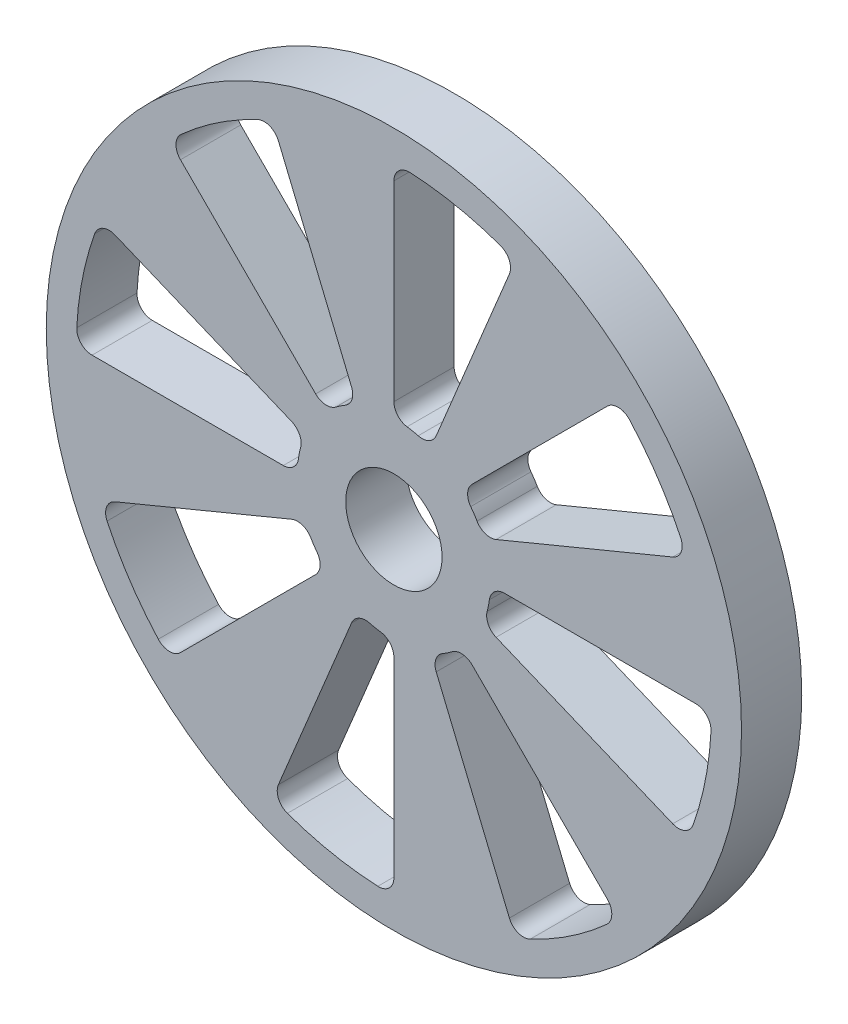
ISO-10303-21;
HEADER;
FILE_DESCRIPTION(('STEP AP214'),'2;1');
FILE_NAME('part.step','',(''),(''),'','','');
FILE_SCHEMA(('AUTOMOTIVE_DESIGN { 1 0 10303 214 1 1 1 1 }'));
ENDSEC;
DATA;
#1=APPLICATION_CONTEXT('core data for automotive mechanical design processes');
#2=APPLICATION_PROTOCOL_DEFINITION('international standard','automotive_design',2000,#1);
#3=PRODUCT_CONTEXT('',#1,'mechanical');
#4=PRODUCT('Part','Part','',(#3));
#5=PRODUCT_RELATED_PRODUCT_CATEGORY('part','',(#4));
#6=PRODUCT_DEFINITION_FORMATION('','',#4);
#7=PRODUCT_DEFINITION_CONTEXT('part definition',#1,'design');
#8=PRODUCT_DEFINITION('design','',#6,#7);
#9=PRODUCT_DEFINITION_SHAPE('','',#8);
#10=(LENGTH_UNIT() NAMED_UNIT(*) SI_UNIT(.MILLI.,.METRE.));
#11=(NAMED_UNIT(*) PLANE_ANGLE_UNIT() SI_UNIT($,.RADIAN.));
#12=(NAMED_UNIT(*) SI_UNIT($,.STERADIAN.) SOLID_ANGLE_UNIT());
#13=UNCERTAINTY_MEASURE_WITH_UNIT(LENGTH_MEASURE(1.E-05),#10,'distance_accuracy_value','');
#14=(GEOMETRIC_REPRESENTATION_CONTEXT(3) GLOBAL_UNCERTAINTY_ASSIGNED_CONTEXT((#13)) GLOBAL_UNIT_ASSIGNED_CONTEXT((#10,
#11,#12)) REPRESENTATION_CONTEXT('',''));
#15=CARTESIAN_POINT('',(0.,0.,0.));
#16=DIRECTION('',(0.,0.,1.));
#17=DIRECTION('',(1.,0.,0.));
#18=AXIS2_PLACEMENT_3D('',#15,#16,#17);
#19=CARTESIAN_POINT('',(0.,0.,5.));
#20=DIRECTION('',(0.,0.,-1.));
#21=DIRECTION('',(-1.,0.,0.));
#22=AXIS2_PLACEMENT_3D('',#19,#20,#21);
#23=CYLINDRICAL_SURFACE('',#22,26.355);
#24=CARTESIAN_POINT('',(0.,0.,5.));
#25=DIRECTION('',(0.,0.,1.));
#26=DIRECTION('',(1.,0.,0.));
#27=AXIS2_PLACEMENT_3D('',#24,#25,#26);
#28=CIRCLE('',#27,26.355);
#29=CARTESIAN_POINT('',(23.8070063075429,11.3054179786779,5.));
#30=VERTEX_POINT('',#29);
#31=CARTESIAN_POINT('',(19.5553911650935,17.6684097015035,5.));
#32=VERTEX_POINT('',#31);
#33=EDGE_CURVE('E1067',#30,#32,#28,.T.);
#34=ORIENTED_EDGE('',*,*,#33,.T.);
#35=DIRECTION('',(0.,0.,-1.));
#36=VECTOR('',#35,1.);
#37=CARTESIAN_POINT('',(19.5553911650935,17.6684097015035,5.));
#38=LINE('',#37,#36);
#39=CARTESIAN_POINT('',(19.5553911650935,17.6684097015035,0.));
#40=VERTEX_POINT('',#39);
#41=EDGE_CURVE('E792',#32,#40,#38,.T.);
#42=ORIENTED_EDGE('',*,*,#41,.T.);
#43=CARTESIAN_POINT('',(0.,0.,0.));
#44=DIRECTION('',(0.,0.,1.));
#45=DIRECTION('',(1.,0.,0.));
#46=AXIS2_PLACEMENT_3D('',#43,#44,#45);
#47=CIRCLE('',#46,26.355);
#48=CARTESIAN_POINT('',(23.8070063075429,11.3054179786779,0.));
#49=VERTEX_POINT('',#48);
#50=EDGE_CURVE('E555',#49,#40,#47,.T.);
#51=ORIENTED_EDGE('',*,*,#50,.F.);
#52=DIRECTION('',(0.,0.,-1.));
#53=VECTOR('',#52,1.);
#54=CARTESIAN_POINT('',(23.8070063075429,11.3054179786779,5.));
#55=LINE('',#54,#53);
#56=EDGE_CURVE('E789',#49,#30,#55,.F.);
#57=ORIENTED_EDGE('',*,*,#56,.T.);
#58=EDGE_LOOP('',(#34,#42,#51,#57));
#59=FACE_BOUND('',#58,.T.);
#60=ADVANCED_FACE('F39',(#59),#23,.F.);
#61=CARTESIAN_POINT('',(0.,0.,5.));
#62=DIRECTION('',(-0.382683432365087,0.923879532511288,0.));
#63=DIRECTION('',(-0.923879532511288,-0.382683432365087,0.));
#64=AXIS2_PLACEMENT_3D('',#61,#62,#63);
#65=PLANE('',#64);
#66=DIRECTION('',(0.923879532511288,0.382683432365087,0.));
#67=VECTOR('',#66,1.);
#68=CARTESIAN_POINT('',(0.,0.,0.));
#69=LINE('',#68,#67);
#70=CARTESIAN_POINT('',(8.48360901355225,3.51402591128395,0.));
#71=VERTEX_POINT('',#70);
#72=CARTESIAN_POINT('',(23.1457974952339,9.58730323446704,0.));
#73=VERTEX_POINT('',#72);
#74=EDGE_CURVE('E543',#71,#73,#69,.T.);
#75=ORIENTED_EDGE('',*,*,#74,.F.);
#76=DIRECTION('',(0.,0.,-1.));
#77=VECTOR('',#76,1.);
#78=CARTESIAN_POINT('',(8.48360901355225,3.51402591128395,5.));
#79=LINE('',#78,#77);
#80=CARTESIAN_POINT('',(8.48360901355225,3.51402591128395,5.));
#81=VERTEX_POINT('',#80);
#82=EDGE_CURVE('E800',#71,#81,#79,.F.);
#83=ORIENTED_EDGE('',*,*,#82,.T.);
#84=DIRECTION('',(0.923879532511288,0.382683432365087,0.));
#85=VECTOR('',#84,1.);
#86=CARTESIAN_POINT('',(0.,0.,5.));
#87=LINE('',#86,#85);
#88=CARTESIAN_POINT('',(23.1457974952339,9.58730323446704,5.));
#89=VERTEX_POINT('',#88);
#90=EDGE_CURVE('E1062',#81,#89,#87,.T.);
#91=ORIENTED_EDGE('',*,*,#90,.T.);
#92=DIRECTION('',(0.,0.,1.));
#93=VECTOR('',#92,1.);
#94=CARTESIAN_POINT('',(23.1457974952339,9.58730323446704,0.));
#95=LINE('',#94,#93);
#96=EDGE_CURVE('E796',#89,#73,#95,.F.);
#97=ORIENTED_EDGE('',*,*,#96,.T.);
#98=EDGE_LOOP('',(#75,#83,#91,#97));
#99=FACE_BOUND('',#98,.T.);
#100=ADVANCED_FACE('F1097',(#99),#65,.T.);
#101=CARTESIAN_POINT('',(0.,0.,5.));
#102=DIRECTION('',(0.,0.,-1.));
#103=DIRECTION('',(-1.,0.,0.));
#104=AXIS2_PLACEMENT_3D('',#101,#102,#103);
#105=CYLINDRICAL_SURFACE('',#104,8.);
#106=CARTESIAN_POINT('',(0.,0.,0.));
#107=DIRECTION('',(0.,0.,1.));
#108=DIRECTION('',(1.,0.,0.));
#109=AXIS2_PLACEMENT_3D('',#106,#107,#108);
#110=CIRCLE('',#109,8.);
#111=CARTESIAN_POINT('',(6.90192108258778,4.04518051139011,0.));
#112=VERTEX_POINT('',#111);
#113=CARTESIAN_POINT('',(6.37851032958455,4.82852006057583,0.));
#114=VERTEX_POINT('',#113);
#115=EDGE_CURVE('E528',#112,#114,#110,.T.);
#116=ORIENTED_EDGE('',*,*,#115,.T.);
#117=DIRECTION('',(0.,0.,-1.));
#118=VECTOR('',#117,1.);
#119=CARTESIAN_POINT('',(6.37851032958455,4.82852006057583,5.));
#120=LINE('',#119,#118);
#121=CARTESIAN_POINT('',(6.37851032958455,4.82852006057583,5.));
#122=VERTEX_POINT('',#121);
#123=EDGE_CURVE('E676',#114,#122,#120,.F.);
#124=ORIENTED_EDGE('',*,*,#123,.T.);
#125=CARTESIAN_POINT('',(0.,0.,5.));
#126=DIRECTION('',(0.,0.,1.));
#127=DIRECTION('',(1.,0.,0.));
#128=AXIS2_PLACEMENT_3D('',#125,#126,#127);
#129=CIRCLE('',#128,8.);
#130=CARTESIAN_POINT('',(6.90192108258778,4.04518051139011,5.));
#131=VERTEX_POINT('',#130);
#132=EDGE_CURVE('E1066',#131,#122,#129,.T.);
#133=ORIENTED_EDGE('',*,*,#132,.F.);
#134=DIRECTION('',(0.,0.,-1.));
#135=VECTOR('',#134,1.);
#136=CARTESIAN_POINT('',(6.90192108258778,4.04518051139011,5.));
#137=LINE('',#136,#135);
#138=EDGE_CURVE('E673',#131,#112,#137,.T.);
#139=ORIENTED_EDGE('',*,*,#138,.T.);
#140=EDGE_LOOP('',(#116,#124,#133,#139));
#141=FACE_BOUND('',#140,.T.);
#142=ADVANCED_FACE('F1104',(#141),#105,.T.);
#143=CARTESIAN_POINT('',(0.,0.,5.));
#144=DIRECTION('',(-0.923879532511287,0.382683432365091,0.));
#145=DIRECTION('',(-0.382683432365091,-0.923879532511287,0.));
#146=AXIS2_PLACEMENT_3D('',#143,#144,#145);
#147=PLANE('',#146);
#148=DIRECTION('',(0.382683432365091,0.923879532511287,0.));
#149=VECTOR('',#148,1.);
#150=CARTESIAN_POINT('',(0.,0.,0.));
#151=LINE('',#150,#149);
#152=CARTESIAN_POINT('',(3.51402591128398,8.48360901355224,0.));
#153=VERTEX_POINT('',#152);
#154=CARTESIAN_POINT('',(9.58730323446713,23.1457974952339,0.));
#155=VERTEX_POINT('',#154);
#156=EDGE_CURVE('E490',#153,#155,#151,.T.);
#157=ORIENTED_EDGE('',*,*,#156,.F.);
#158=DIRECTION('',(0.,0.,-1.));
#159=VECTOR('',#158,1.);
#160=CARTESIAN_POINT('',(3.51402591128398,8.48360901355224,5.));
#161=LINE('',#160,#159);
#162=CARTESIAN_POINT('',(3.51402591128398,8.48360901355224,5.));
#163=VERTEX_POINT('',#162);
#164=EDGE_CURVE('E807',#153,#163,#161,.F.);
#165=ORIENTED_EDGE('',*,*,#164,.T.);
#166=DIRECTION('',(0.382683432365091,0.923879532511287,0.));
#167=VECTOR('',#166,1.);
#168=CARTESIAN_POINT('',(0.,0.,5.));
#169=LINE('',#168,#167);
#170=CARTESIAN_POINT('',(9.58730323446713,23.1457974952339,5.));
#171=VERTEX_POINT('',#170);
#172=EDGE_CURVE('E1052',#163,#171,#169,.T.);
#173=ORIENTED_EDGE('',*,*,#172,.T.);
#174=DIRECTION('',(0.,0.,1.));
#175=VECTOR('',#174,1.);
#176=CARTESIAN_POINT('',(9.58730323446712,23.1457974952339,0.));
#177=LINE('',#176,#175);
#178=EDGE_CURVE('E803',#171,#155,#177,.F.);
#179=ORIENTED_EDGE('',*,*,#178,.T.);
#180=EDGE_LOOP('',(#157,#165,#173,#179));
#181=FACE_BOUND('',#180,.T.);
#182=ADVANCED_FACE('F1160',(#181),#147,.T.);
#183=CARTESIAN_POINT('',(2.02002062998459,7.74076977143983,0.));
#184=VERTEX_POINT('',#183);
#185=CARTESIAN_POINT('',(1.09600862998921,7.92456718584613,0.));
#186=VERTEX_POINT('',#185);
#187=EDGE_CURVE('E476',#184,#186,#110,.T.);
#188=ORIENTED_EDGE('',*,*,#187,.T.);
#189=DIRECTION('',(0.,0.,-1.));
#190=VECTOR('',#189,1.);
#191=CARTESIAN_POINT('',(1.09600862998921,7.92456718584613,5.));
#192=LINE('',#191,#190);
#193=CARTESIAN_POINT('',(1.09600862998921,7.92456718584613,5.));
#194=VERTEX_POINT('',#193);
#195=EDGE_CURVE('E744',#186,#194,#192,.F.);
#196=ORIENTED_EDGE('',*,*,#195,.T.);
#197=CARTESIAN_POINT('',(2.02002062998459,7.74076977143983,5.));
#198=VERTEX_POINT('',#197);
#199=EDGE_CURVE('E1056',#198,#194,#129,.T.);
#200=ORIENTED_EDGE('',*,*,#199,.F.);
#201=DIRECTION('',(0.,0.,-1.));
#202=VECTOR('',#201,1.);
#203=CARTESIAN_POINT('',(2.02002062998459,7.74076977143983,5.));
#204=LINE('',#203,#202);
#205=EDGE_CURVE('E740',#198,#184,#204,.T.);
#206=ORIENTED_EDGE('',*,*,#205,.T.);
#207=EDGE_LOOP('',(#188,#196,#200,#206));
#208=FACE_BOUND('',#207,.T.);
#209=ADVANCED_FACE('F1150',(#208),#105,.T.);
#210=CARTESIAN_POINT('',(0.,0.,5.));
#211=DIRECTION('',(-1.,0.,0.));
#212=DIRECTION('',(0.,0.,1.));
#213=AXIS2_PLACEMENT_3D('',#210,#211,#212);
#214=PLANE('',#213);
#215=DIRECTION('',(0.,1.,0.));
#216=VECTOR('',#215,1.);
#217=CARTESIAN_POINT('',(0.,0.,5.));
#218=LINE('',#217,#216);
#219=CARTESIAN_POINT('',(0.,9.1825922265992,5.));
#220=VERTEX_POINT('',#219);
#221=CARTESIAN_POINT('',(0.,25.0528306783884,5.));
#222=VERTEX_POINT('',#221);
#223=EDGE_CURVE('E1057',#220,#222,#218,.T.);
#224=ORIENTED_EDGE('',*,*,#223,.F.);
#225=DIRECTION('',(0.,0.,1.));
#226=VECTOR('',#225,1.);
#227=CARTESIAN_POINT('',(0.,9.1825922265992,0.));
#228=LINE('',#227,#226);
#229=CARTESIAN_POINT('',(0.,9.1825922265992,0.));
#230=VERTEX_POINT('',#229);
#231=EDGE_CURVE('E736',#220,#230,#228,.F.);
#232=ORIENTED_EDGE('',*,*,#231,.T.);
#233=DIRECTION('',(0.,1.,0.));
#234=VECTOR('',#233,1.);
#235=CARTESIAN_POINT('',(0.,0.,0.));
#236=LINE('',#235,#234);
#237=CARTESIAN_POINT('',(0.,25.0528306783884,0.));
#238=VERTEX_POINT('',#237);
#239=EDGE_CURVE('E489',#230,#238,#236,.T.);
#240=ORIENTED_EDGE('',*,*,#239,.T.);
#241=DIRECTION('',(0.,0.,-1.));
#242=VECTOR('',#241,1.);
#243=CARTESIAN_POINT('',(0.,25.0528306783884,5.));
#244=LINE('',#243,#242);
#245=EDGE_CURVE('E733',#238,#222,#244,.F.);
#246=ORIENTED_EDGE('',*,*,#245,.T.);
#247=EDGE_LOOP('',(#224,#232,#240,#246));
#248=FACE_BOUND('',#247,.T.);
#249=ADVANCED_FACE('F1143',(#248),#214,.F.);
#250=CARTESIAN_POINT('',(0.,0.,5.));
#251=DIRECTION('',(-0.923879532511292,-0.382683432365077,0.));
#252=DIRECTION('',(0.382683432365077,-0.923879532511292,0.));
#253=AXIS2_PLACEMENT_3D('',#250,#251,#252);
#254=PLANE('',#253);
#255=DIRECTION('',(-0.382683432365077,0.923879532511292,0.));
#256=VECTOR('',#255,1.);
#257=CARTESIAN_POINT('',(0.,0.,0.));
#258=LINE('',#257,#256);
#259=CARTESIAN_POINT('',(-3.51402591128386,8.48360901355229,0.));
#260=VERTEX_POINT('',#259);
#261=CARTESIAN_POINT('',(-9.58730323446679,23.1457974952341,0.));
#262=VERTEX_POINT('',#261);
#263=EDGE_CURVE('E474',#260,#262,#258,.T.);
#264=ORIENTED_EDGE('',*,*,#263,.F.);
#265=DIRECTION('',(0.,0.,-1.));
#266=VECTOR('',#265,1.);
#267=CARTESIAN_POINT('',(-3.51402591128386,8.48360901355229,5.));
#268=LINE('',#267,#266);
#269=CARTESIAN_POINT('',(-3.51402591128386,8.48360901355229,5.));
#270=VERTEX_POINT('',#269);
#271=EDGE_CURVE('E447',#260,#270,#268,.F.);
#272=ORIENTED_EDGE('',*,*,#271,.T.);
#273=DIRECTION('',(-0.382683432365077,0.923879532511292,0.));
#274=VECTOR('',#273,1.);
#275=CARTESIAN_POINT('',(0.,0.,5.));
#276=LINE('',#275,#274);
#277=CARTESIAN_POINT('',(-9.58730323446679,23.1457974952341,5.));
#278=VERTEX_POINT('',#277);
#279=EDGE_CURVE('E1043',#270,#278,#276,.T.);
#280=ORIENTED_EDGE('',*,*,#279,.T.);
#281=DIRECTION('',(0.,0.,1.));
#282=VECTOR('',#281,1.);
#283=CARTESIAN_POINT('',(-9.58730323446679,23.145797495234,0.));
#284=LINE('',#283,#282);
#285=EDGE_CURVE('E465',#278,#262,#284,.F.);
#286=ORIENTED_EDGE('',*,*,#285,.T.);
#287=EDGE_LOOP('',(#264,#272,#280,#286));
#288=FACE_BOUND('',#287,.T.);
#289=ADVANCED_FACE('F1297',(#288),#254,.T.);
#290=CARTESIAN_POINT('',(-4.04518051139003,6.90192108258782,5.));
#291=VERTEX_POINT('',#290);
#292=CARTESIAN_POINT('',(-4.82852006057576,6.3785103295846,5.));
#293=VERTEX_POINT('',#292);
#294=EDGE_CURVE('E463',#291,#293,#129,.T.);
#295=ORIENTED_EDGE('',*,*,#294,.F.);
#296=DIRECTION('',(0.,0.,-1.));
#297=VECTOR('',#296,1.);
#298=CARTESIAN_POINT('',(-4.04518051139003,6.90192108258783,5.));
#299=LINE('',#298,#297);
#300=CARTESIAN_POINT('',(-4.04518051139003,6.90192108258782,0.));
#301=VERTEX_POINT('',#300);
#302=EDGE_CURVE('E446',#291,#301,#299,.T.);
#303=ORIENTED_EDGE('',*,*,#302,.T.);
#304=CARTESIAN_POINT('',(-4.82852006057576,6.3785103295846,0.));
#305=VERTEX_POINT('',#304);
#306=EDGE_CURVE('E460',#301,#305,#110,.T.);
#307=ORIENTED_EDGE('',*,*,#306,.T.);
#308=DIRECTION('',(0.,0.,-1.));
#309=VECTOR('',#308,1.);
#310=CARTESIAN_POINT('',(-4.82852006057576,6.3785103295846,5.));
#311=LINE('',#310,#309);
#312=EDGE_CURVE('E466',#305,#293,#311,.F.);
#313=ORIENTED_EDGE('',*,*,#312,.T.);
#314=EDGE_LOOP('',(#295,#303,#307,#313));
#315=FACE_BOUND('',#314,.T.);
#316=ADVANCED_FACE('F459',(#315),#105,.T.);
#317=CARTESIAN_POINT('',(0.,0.,5.));
#318=DIRECTION('',(-0.707106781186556,-0.707106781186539,0.));
#319=DIRECTION('',(0.707106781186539,-0.707106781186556,0.));
#320=AXIS2_PLACEMENT_3D('',#317,#318,#319);
#321=PLANE('',#320);
#322=DIRECTION('',(-0.707106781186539,0.707106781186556,0.));
#323=VECTOR('',#322,1.);
#324=CARTESIAN_POINT('',(0.,0.,0.));
#325=LINE('',#324,#323);
#326=CARTESIAN_POINT('',(-6.49307323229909,6.49307323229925,0.));
#327=VERTEX_POINT('',#326);
#328=CARTESIAN_POINT('',(-17.7150264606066,17.715026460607,0.));
#329=VERTEX_POINT('',#328);
#330=EDGE_CURVE('E473',#327,#329,#325,.T.);
#331=ORIENTED_EDGE('',*,*,#330,.T.);
#332=DIRECTION('',(0.,0.,-1.));
#333=VECTOR('',#332,1.);
#334=CARTESIAN_POINT('',(-17.7150264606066,17.715026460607,5.));
#335=LINE('',#334,#333);
#336=CARTESIAN_POINT('',(-17.7150264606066,17.715026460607,5.));
#337=VERTEX_POINT('',#336);
#338=EDGE_CURVE('E779',#329,#337,#335,.F.);
#339=ORIENTED_EDGE('',*,*,#338,.T.);
#340=DIRECTION('',(-0.707106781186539,0.707106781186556,0.));
#341=VECTOR('',#340,1.);
#342=CARTESIAN_POINT('',(0.,0.,5.));
#343=LINE('',#342,#341);
#344=CARTESIAN_POINT('',(-6.49307323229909,6.49307323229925,5.));
#345=VERTEX_POINT('',#344);
#346=EDGE_CURVE('E1047',#345,#337,#343,.T.);
#347=ORIENTED_EDGE('',*,*,#346,.F.);
#348=DIRECTION('',(0.,0.,1.));
#349=VECTOR('',#348,1.);
#350=CARTESIAN_POINT('',(-6.49307323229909,6.49307323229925,0.));
#351=LINE('',#350,#349);
#352=EDGE_CURVE('E775',#345,#327,#351,.F.);
#353=ORIENTED_EDGE('',*,*,#352,.T.);
#354=EDGE_LOOP('',(#331,#339,#347,#353));
#355=FACE_BOUND('',#354,.T.);
#356=ADVANCED_FACE('F1299',(#355),#321,.F.);
#357=CARTESIAN_POINT('',(0.,0.,5.));
#358=DIRECTION('',(-0.3826834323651,-0.923879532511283,0.));
#359=DIRECTION('',(0.923879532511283,-0.3826834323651,0.));
#360=AXIS2_PLACEMENT_3D('',#357,#358,#359);
#361=PLANE('',#360);
#362=DIRECTION('',(-0.923879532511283,0.3826834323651,0.));
#363=VECTOR('',#362,1.);
#364=CARTESIAN_POINT('',(0.,0.,0.));
#365=LINE('',#364,#363);
#366=CARTESIAN_POINT('',(-8.48360901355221,3.51402591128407,0.));
#367=VERTEX_POINT('',#366);
#368=CARTESIAN_POINT('',(-23.1457974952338,9.58730323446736,0.));
#369=VERTEX_POINT('',#368);
#370=EDGE_CURVE('E512',#367,#369,#365,.T.);
#371=ORIENTED_EDGE('',*,*,#370,.F.);
#372=DIRECTION('',(0.,0.,-1.));
#373=VECTOR('',#372,1.);
#374=CARTESIAN_POINT('',(-8.48360901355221,3.51402591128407,5.));
#375=LINE('',#374,#373);
#376=CARTESIAN_POINT('',(-8.48360901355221,3.51402591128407,5.));
#377=VERTEX_POINT('',#376);
#378=EDGE_CURVE('E636',#367,#377,#375,.F.);
#379=ORIENTED_EDGE('',*,*,#378,.T.);
#380=DIRECTION('',(-0.923879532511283,0.3826834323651,0.));
#381=VECTOR('',#380,1.);
#382=CARTESIAN_POINT('',(0.,0.,5.));
#383=LINE('',#382,#381);
#384=CARTESIAN_POINT('',(-23.1457974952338,9.58730323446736,5.));
#385=VERTEX_POINT('',#384);
#386=EDGE_CURVE('E1035',#377,#385,#383,.T.);
#387=ORIENTED_EDGE('',*,*,#386,.T.);
#388=DIRECTION('',(0.,0.,1.));
#389=VECTOR('',#388,1.);
#390=CARTESIAN_POINT('',(-23.1457974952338,9.58730323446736,0.));
#391=LINE('',#390,#389);
#392=EDGE_CURVE('E632',#385,#369,#391,.F.);
#393=ORIENTED_EDGE('',*,*,#392,.T.);
#394=EDGE_LOOP('',(#371,#379,#387,#393));
#395=FACE_BOUND('',#394,.T.);
#396=ADVANCED_FACE('F1305',(#395),#361,.T.);
#397=CARTESIAN_POINT('',(-7.74076977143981,2.02002062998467,5.));
#398=VERTEX_POINT('',#397);
#399=CARTESIAN_POINT('',(-7.92456718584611,1.0960086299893,5.));
#400=VERTEX_POINT('',#399);
#401=EDGE_CURVE('E1024',#398,#400,#129,.T.);
#402=ORIENTED_EDGE('',*,*,#401,.F.);
#403=DIRECTION('',(0.,0.,-1.));
#404=VECTOR('',#403,1.);
#405=CARTESIAN_POINT('',(-7.74076977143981,2.02002062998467,5.));
#406=LINE('',#405,#404);
#407=CARTESIAN_POINT('',(-7.74076977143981,2.02002062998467,0.));
#408=VERTEX_POINT('',#407);
#409=EDGE_CURVE('E629',#398,#408,#406,.T.);
#410=ORIENTED_EDGE('',*,*,#409,.T.);
#411=CARTESIAN_POINT('',(-7.92456718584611,1.0960086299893,0.));
#412=VERTEX_POINT('',#411);
#413=EDGE_CURVE('E496',#408,#412,#110,.T.);
#414=ORIENTED_EDGE('',*,*,#413,.T.);
#415=DIRECTION('',(0.,0.,-1.));
#416=VECTOR('',#415,1.);
#417=CARTESIAN_POINT('',(-7.92456718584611,1.0960086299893,5.));
#418=LINE('',#417,#416);
#419=EDGE_CURVE('E626',#412,#400,#418,.F.);
#420=ORIENTED_EDGE('',*,*,#419,.T.);
#421=EDGE_LOOP('',(#402,#410,#414,#420));
#422=FACE_BOUND('',#421,.T.);
#423=ADVANCED_FACE('F1300',(#422),#105,.T.);
#424=CARTESIAN_POINT('',(0.,0.,5.));
#425=DIRECTION('',(0.,-1.,0.));
#426=DIRECTION('',(1.,0.,0.));
#427=AXIS2_PLACEMENT_3D('',#424,#425,#426);
#428=PLANE('',#427);
#429=DIRECTION('',(-1.,0.,0.));
#430=VECTOR('',#429,1.);
#431=CARTESIAN_POINT('',(0.,0.,0.));
#432=LINE('',#431,#430);
#433=CARTESIAN_POINT('',(-9.1825922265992,0.,0.));
#434=VERTEX_POINT('',#433);
#435=CARTESIAN_POINT('',(-25.0528306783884,2.6241447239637E-13,0.));
#436=VERTEX_POINT('',#435);
#437=EDGE_CURVE('E511',#434,#436,#432,.T.);
#438=ORIENTED_EDGE('',*,*,#437,.T.);
#439=DIRECTION('',(0.,0.,-1.));
#440=VECTOR('',#439,1.);
#441=CARTESIAN_POINT('',(-25.0528306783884,2.6241447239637E-13,5.));
#442=LINE('',#441,#440);
#443=CARTESIAN_POINT('',(-25.0528306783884,2.6241447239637E-13,5.));
#444=VERTEX_POINT('',#443);
#445=EDGE_CURVE('E765',#436,#444,#442,.F.);
#446=ORIENTED_EDGE('',*,*,#445,.T.);
#447=DIRECTION('',(-1.,0.,0.));
#448=VECTOR('',#447,1.);
#449=CARTESIAN_POINT('',(0.,0.,5.));
#450=LINE('',#449,#448);
#451=CARTESIAN_POINT('',(-9.1825922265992,0.,5.));
#452=VERTEX_POINT('',#451);
#453=EDGE_CURVE('E1039',#452,#444,#450,.T.);
#454=ORIENTED_EDGE('',*,*,#453,.F.);
#455=DIRECTION('',(0.,0.,1.));
#456=VECTOR('',#455,1.);
#457=CARTESIAN_POINT('',(-9.1825922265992,0.,0.));
#458=LINE('',#457,#456);
#459=EDGE_CURVE('E761',#452,#434,#458,.F.);
#460=ORIENTED_EDGE('',*,*,#459,.T.);
#461=EDGE_LOOP('',(#438,#446,#454,#460));
#462=FACE_BOUND('',#461,.T.);
#463=ADVANCED_FACE('F1311',(#462),#428,.F.);
#464=CARTESIAN_POINT('',(0.,0.,5.));
#465=DIRECTION('',(0.38268343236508,-0.923879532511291,0.));
#466=DIRECTION('',(0.923879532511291,0.38268343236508,0.));
#467=AXIS2_PLACEMENT_3D('',#464,#465,#466);
#468=PLANE('',#467);
#469=DIRECTION('',(-0.923879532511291,-0.38268343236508,0.));
#470=VECTOR('',#469,1.);
#471=CARTESIAN_POINT('',(0.,0.,0.));
#472=LINE('',#471,#470);
#473=CARTESIAN_POINT('',(-8.48360901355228,-3.51402591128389,0.));
#474=VERTEX_POINT('',#473);
#475=CARTESIAN_POINT('',(-23.145797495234,-9.58730323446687,0.));
#476=VERTEX_POINT('',#475);
#477=EDGE_CURVE('E495',#474,#476,#472,.T.);
#478=ORIENTED_EDGE('',*,*,#477,.F.);
#479=DIRECTION('',(0.,0.,-1.));
#480=VECTOR('',#479,1.);
#481=CARTESIAN_POINT('',(-8.48360901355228,-3.51402591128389,5.));
#482=LINE('',#481,#480);
#483=CARTESIAN_POINT('',(-8.48360901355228,-3.51402591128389,5.));
#484=VERTEX_POINT('',#483);
#485=EDGE_CURVE('E623',#474,#484,#482,.F.);
#486=ORIENTED_EDGE('',*,*,#485,.T.);
#487=DIRECTION('',(-0.923879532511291,-0.38268343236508,0.));
#488=VECTOR('',#487,1.);
#489=CARTESIAN_POINT('',(0.,0.,5.));
#490=LINE('',#489,#488);
#491=CARTESIAN_POINT('',(-23.145797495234,-9.58730323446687,5.));
#492=VERTEX_POINT('',#491);
#493=EDGE_CURVE('E1009',#484,#492,#490,.T.);
#494=ORIENTED_EDGE('',*,*,#493,.T.);
#495=DIRECTION('',(0.,0.,1.));
#496=VECTOR('',#495,1.);
#497=CARTESIAN_POINT('',(-23.145797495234,-9.58730323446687,0.));
#498=LINE('',#497,#496);
#499=EDGE_CURVE('E619',#492,#476,#498,.F.);
#500=ORIENTED_EDGE('',*,*,#499,.T.);
#501=EDGE_LOOP('',(#478,#486,#494,#500));
#502=FACE_BOUND('',#501,.T.);
#503=ADVANCED_FACE('F1013',(#502),#468,.T.);
#504=CARTESIAN_POINT('',(-6.90192108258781,-4.04518051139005,5.));
#505=VERTEX_POINT('',#504);
#506=CARTESIAN_POINT('',(-6.37851032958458,-4.82852006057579,5.));
#507=VERTEX_POINT('',#506);
#508=EDGE_CURVE('E1016',#505,#507,#129,.T.);
#509=ORIENTED_EDGE('',*,*,#508,.F.);
#510=DIRECTION('',(0.,0.,-1.));
#511=VECTOR('',#510,1.);
#512=CARTESIAN_POINT('',(-6.90192108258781,-4.04518051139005,5.));
#513=LINE('',#512,#511);
#514=CARTESIAN_POINT('',(-6.90192108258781,-4.04518051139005,0.));
#515=VERTEX_POINT('',#514);
#516=EDGE_CURVE('E616',#505,#515,#513,.T.);
#517=ORIENTED_EDGE('',*,*,#516,.T.);
#518=CARTESIAN_POINT('',(-6.37851032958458,-4.82852006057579,0.));
#519=VERTEX_POINT('',#518);
#520=EDGE_CURVE('E477',#515,#519,#110,.T.);
#521=ORIENTED_EDGE('',*,*,#520,.T.);
#522=DIRECTION('',(0.,0.,-1.));
#523=VECTOR('',#522,1.);
#524=CARTESIAN_POINT('',(-6.37851032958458,-4.82852006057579,5.));
#525=LINE('',#524,#523);
#526=EDGE_CURVE('E613',#519,#507,#525,.F.);
#527=ORIENTED_EDGE('',*,*,#526,.T.);
#528=EDGE_LOOP('',(#509,#517,#521,#527));
#529=FACE_BOUND('',#528,.T.);
#530=ADVANCED_FACE('F1278',(#529),#105,.T.);
#531=CARTESIAN_POINT('',(0.,0.,5.));
#532=DIRECTION('',(0.707106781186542,-0.707106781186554,0.));
#533=DIRECTION('',(0.707106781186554,0.707106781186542,0.));
#534=AXIS2_PLACEMENT_3D('',#531,#532,#533);
#535=PLANE('',#534);
#536=DIRECTION('',(-0.707106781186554,-0.707106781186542,0.));
#537=VECTOR('',#536,1.);
#538=CARTESIAN_POINT('',(0.,0.,5.));
#539=LINE('',#538,#537);
#540=CARTESIAN_POINT('',(-6.49307323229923,-6.49307323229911,5.));
#541=VERTEX_POINT('',#540);
#542=CARTESIAN_POINT('',(-17.715026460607,-17.7150264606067,5.));
#543=VERTEX_POINT('',#542);
#544=EDGE_CURVE('E1022',#541,#543,#539,.T.);
#545=ORIENTED_EDGE('',*,*,#544,.F.);
#546=DIRECTION('',(0.,0.,1.));
#547=VECTOR('',#546,1.);
#548=CARTESIAN_POINT('',(-6.49307323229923,-6.49307323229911,0.));
#549=LINE('',#548,#547);
#550=CARTESIAN_POINT('',(-6.49307323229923,-6.49307323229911,0.));
#551=VERTEX_POINT('',#550);
#552=EDGE_CURVE('E642',#541,#551,#549,.F.);
#553=ORIENTED_EDGE('',*,*,#552,.T.);
#554=DIRECTION('',(-0.707106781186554,-0.707106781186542,0.));
#555=VECTOR('',#554,1.);
#556=CARTESIAN_POINT('',(0.,0.,0.));
#557=LINE('',#556,#555);
#558=CARTESIAN_POINT('',(-17.715026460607,-17.7150264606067,0.));
#559=VERTEX_POINT('',#558);
#560=EDGE_CURVE('E494',#551,#559,#557,.T.);
#561=ORIENTED_EDGE('',*,*,#560,.T.);
#562=DIRECTION('',(0.,0.,-1.));
#563=VECTOR('',#562,1.);
#564=CARTESIAN_POINT('',(-17.715026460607,-17.7150264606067,5.));
#565=LINE('',#564,#563);
#566=EDGE_CURVE('E639',#559,#543,#565,.F.);
#567=ORIENTED_EDGE('',*,*,#566,.T.);
#568=EDGE_LOOP('',(#545,#553,#561,#567));
#569=FACE_BOUND('',#568,.T.);
#570=ADVANCED_FACE('F1322',(#569),#535,.F.);
#571=CARTESIAN_POINT('',(0.,0.,5.));
#572=DIRECTION('',(0.923879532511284,-0.382683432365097,0.));
#573=DIRECTION('',(0.382683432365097,0.923879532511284,0.));
#574=AXIS2_PLACEMENT_3D('',#571,#572,#573);
#575=PLANE('',#574);
#576=DIRECTION('',(-0.382683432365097,-0.923879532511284,0.));
#577=VECTOR('',#576,1.);
#578=CARTESIAN_POINT('',(0.,0.,0.));
#579=LINE('',#578,#577);
#580=CARTESIAN_POINT('',(-3.51402591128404,-8.48360901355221,0.));
#581=VERTEX_POINT('',#580);
#582=CARTESIAN_POINT('',(-9.58730323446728,-23.1457974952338,0.));
#583=VERTEX_POINT('',#582);
#584=EDGE_CURVE('E527',#581,#583,#579,.T.);
#585=ORIENTED_EDGE('',*,*,#584,.F.);
#586=DIRECTION('',(0.,0.,-1.));
#587=VECTOR('',#586,1.);
#588=CARTESIAN_POINT('',(-3.51402591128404,-8.48360901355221,5.));
#589=LINE('',#588,#587);
#590=CARTESIAN_POINT('',(-3.51402591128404,-8.48360901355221,5.));
#591=VERTEX_POINT('',#590);
#592=EDGE_CURVE('E663',#581,#591,#589,.F.);
#593=ORIENTED_EDGE('',*,*,#592,.T.);
#594=DIRECTION('',(-0.382683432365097,-0.923879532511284,0.));
#595=VECTOR('',#594,1.);
#596=CARTESIAN_POINT('',(0.,0.,5.));
#597=LINE('',#596,#595);
#598=CARTESIAN_POINT('',(-9.58730323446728,-23.1457974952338,5.));
#599=VERTEX_POINT('',#598);
#600=EDGE_CURVE('E1191',#591,#599,#597,.T.);
#601=ORIENTED_EDGE('',*,*,#600,.T.);
#602=DIRECTION('',(0.,0.,1.));
#603=VECTOR('',#602,1.);
#604=CARTESIAN_POINT('',(-9.58730323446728,-23.1457974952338,0.));
#605=LINE('',#604,#603);
#606=EDGE_CURVE('E659',#599,#583,#605,.F.);
#607=ORIENTED_EDGE('',*,*,#606,.T.);
#608=EDGE_LOOP('',(#585,#593,#601,#607));
#609=FACE_BOUND('',#608,.T.);
#610=ADVANCED_FACE('F1195',(#609),#575,.T.);
#611=CARTESIAN_POINT('',(-2.02002062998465,-7.74076977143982,0.));
#612=VERTEX_POINT('',#611);
#613=CARTESIAN_POINT('',(-1.09600862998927,-7.92456718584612,0.));
#614=VERTEX_POINT('',#613);
#615=EDGE_CURVE('E513',#612,#614,#110,.T.);
#616=ORIENTED_EDGE('',*,*,#615,.T.);
#617=DIRECTION('',(0.,0.,-1.));
#618=VECTOR('',#617,1.);
#619=CARTESIAN_POINT('',(-1.09600862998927,-7.92456718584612,5.));
#620=LINE('',#619,#618);
#621=CARTESIAN_POINT('',(-1.09600862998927,-7.92456718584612,5.));
#622=VERTEX_POINT('',#621);
#623=EDGE_CURVE('E656',#614,#622,#620,.F.);
#624=ORIENTED_EDGE('',*,*,#623,.T.);
#625=CARTESIAN_POINT('',(-2.02002062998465,-7.74076977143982,5.));
#626=VERTEX_POINT('',#625);
#627=EDGE_CURVE('E1198',#626,#622,#129,.T.);
#628=ORIENTED_EDGE('',*,*,#627,.F.);
#629=DIRECTION('',(0.,0.,-1.));
#630=VECTOR('',#629,1.);
#631=CARTESIAN_POINT('',(-2.02002062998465,-7.74076977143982,5.));
#632=LINE('',#631,#630);
#633=EDGE_CURVE('E653',#626,#612,#632,.T.);
#634=ORIENTED_EDGE('',*,*,#633,.T.);
#635=EDGE_LOOP('',(#616,#624,#628,#634));
#636=FACE_BOUND('',#635,.T.);
#637=ADVANCED_FACE('F1267',(#636),#105,.T.);
#638=CARTESIAN_POINT('',(0.,0.,5.));
#639=DIRECTION('',(1.,0.,0.));
#640=DIRECTION('',(0.,1.,0.));
#641=AXIS2_PLACEMENT_3D('',#638,#639,#640);
#642=PLANE('',#641);
#643=DIRECTION('',(0.,-1.,0.));
#644=VECTOR('',#643,1.);
#645=CARTESIAN_POINT('',(0.,0.,5.));
#646=LINE('',#645,#644);
#647=CARTESIAN_POINT('',(0.,-9.1825922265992,5.));
#648=VERTEX_POINT('',#647);
#649=CARTESIAN_POINT('',(-1.7494298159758E-13,-25.0528306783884,5.));
#650=VERTEX_POINT('',#649);
#651=EDGE_CURVE('E1026',#648,#650,#646,.T.);
#652=ORIENTED_EDGE('',*,*,#651,.F.);
#653=DIRECTION('',(0.,0.,1.));
#654=VECTOR('',#653,1.);
#655=CARTESIAN_POINT('',(0.,-9.1825922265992,0.));
#656=LINE('',#655,#654);
#657=CARTESIAN_POINT('',(0.,-9.1825922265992,0.));
#658=VERTEX_POINT('',#657);
#659=EDGE_CURVE('E649',#648,#658,#656,.F.);
#660=ORIENTED_EDGE('',*,*,#659,.T.);
#661=DIRECTION('',(0.,-1.,0.));
#662=VECTOR('',#661,1.);
#663=CARTESIAN_POINT('',(0.,0.,0.));
#664=LINE('',#663,#662);
#665=CARTESIAN_POINT('',(-1.7494298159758E-13,-25.0528306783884,0.));
#666=VERTEX_POINT('',#665);
#667=EDGE_CURVE('E526',#658,#666,#664,.T.);
#668=ORIENTED_EDGE('',*,*,#667,.T.);
#669=DIRECTION('',(0.,0.,-1.));
#670=VECTOR('',#669,1.);
#671=CARTESIAN_POINT('',(-1.7494298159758E-13,-25.0528306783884,5.));
#672=LINE('',#671,#670);
#673=EDGE_CURVE('E646',#666,#650,#672,.F.);
#674=ORIENTED_EDGE('',*,*,#673,.T.);
#675=EDGE_LOOP('',(#652,#660,#668,#674));
#676=FACE_BOUND('',#675,.T.);
#677=ADVANCED_FACE('F1275',(#676),#642,.F.);
#678=CARTESIAN_POINT('',(0.,0.,5.));
#679=DIRECTION('',(0.923879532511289,0.382683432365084,0.));
#680=DIRECTION('',(-0.382683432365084,0.923879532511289,0.));
#681=AXIS2_PLACEMENT_3D('',#678,#679,#680);
#682=PLANE('',#681);
#683=DIRECTION('',(0.382683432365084,-0.923879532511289,0.));
#684=VECTOR('',#683,1.);
#685=CARTESIAN_POINT('',(0.,0.,0.));
#686=LINE('',#685,#684);
#687=CARTESIAN_POINT('',(3.51402591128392,-8.48360901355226,0.));
#688=VERTEX_POINT('',#687);
#689=CARTESIAN_POINT('',(9.58730323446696,-23.145797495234,0.));
#690=VERTEX_POINT('',#689);
#691=EDGE_CURVE('E573',#688,#690,#686,.T.);
#692=ORIENTED_EDGE('',*,*,#691,.F.);
#693=DIRECTION('',(0.,0.,-1.));
#694=VECTOR('',#693,1.);
#695=CARTESIAN_POINT('',(3.51402591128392,-8.48360901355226,5.));
#696=LINE('',#695,#694);
#697=CARTESIAN_POINT('',(3.51402591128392,-8.48360901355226,5.));
#698=VERTEX_POINT('',#697);
#699=EDGE_CURVE('E702',#688,#698,#696,.F.);
#700=ORIENTED_EDGE('',*,*,#699,.T.);
#701=DIRECTION('',(0.382683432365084,-0.923879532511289,0.));
#702=VECTOR('',#701,1.);
#703=CARTESIAN_POINT('',(0.,0.,5.));
#704=LINE('',#703,#702);
#705=CARTESIAN_POINT('',(9.58730323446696,-23.145797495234,5.));
#706=VERTEX_POINT('',#705);
#707=EDGE_CURVE('E1210',#698,#706,#704,.T.);
#708=ORIENTED_EDGE('',*,*,#707,.T.);
#709=DIRECTION('',(0.,0.,1.));
#710=VECTOR('',#709,1.);
#711=CARTESIAN_POINT('',(9.58730323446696,-23.145797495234,0.));
#712=LINE('',#711,#710);
#713=EDGE_CURVE('E698',#706,#690,#712,.F.);
#714=ORIENTED_EDGE('',*,*,#713,.T.);
#715=EDGE_LOOP('',(#692,#700,#708,#714));
#716=FACE_BOUND('',#715,.T.);
#717=ADVANCED_FACE('F1260',(#716),#682,.T.);
#718=CARTESIAN_POINT('',(4.04518051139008,-6.90192108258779,5.));
#719=VERTEX_POINT('',#718);
#720=CARTESIAN_POINT('',(4.82852006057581,-6.37851032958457,5.));
#721=VERTEX_POINT('',#720);
#722=EDGE_CURVE('E1209',#719,#721,#129,.T.);
#723=ORIENTED_EDGE('',*,*,#722,.F.);
#724=DIRECTION('',(0.,0.,-1.));
#725=VECTOR('',#724,1.);
#726=CARTESIAN_POINT('',(4.04518051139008,-6.9019210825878,5.));
#727=LINE('',#726,#725);
#728=CARTESIAN_POINT('',(4.04518051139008,-6.90192108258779,0.));
#729=VERTEX_POINT('',#728);
#730=EDGE_CURVE('E695',#719,#729,#727,.T.);
#731=ORIENTED_EDGE('',*,*,#730,.T.);
#732=CARTESIAN_POINT('',(4.82852006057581,-6.37851032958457,0.));
#733=VERTEX_POINT('',#732);
#734=EDGE_CURVE('E491',#729,#733,#110,.T.);
#735=ORIENTED_EDGE('',*,*,#734,.T.);
#736=DIRECTION('',(0.,0.,-1.));
#737=VECTOR('',#736,1.);
#738=CARTESIAN_POINT('',(4.82852006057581,-6.37851032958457,5.));
#739=LINE('',#738,#737);
#740=EDGE_CURVE('E692',#733,#721,#739,.F.);
#741=ORIENTED_EDGE('',*,*,#740,.T.);
#742=EDGE_LOOP('',(#723,#731,#735,#741));
#743=FACE_BOUND('',#742,.T.);
#744=ADVANCED_FACE('F1264',(#743),#105,.T.);
#745=CARTESIAN_POINT('',(0.,0.,5.));
#746=DIRECTION('',(0.707106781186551,0.707106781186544,0.));
#747=DIRECTION('',(-0.707106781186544,0.707106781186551,0.));
#748=AXIS2_PLACEMENT_3D('',#745,#746,#747);
#749=PLANE('',#748);
#750=DIRECTION('',(0.707106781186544,-0.707106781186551,0.));
#751=VECTOR('',#750,1.);
#752=CARTESIAN_POINT('',(0.,0.,5.));
#753=LINE('',#752,#751);
#754=CARTESIAN_POINT('',(6.49307323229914,-6.49307323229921,5.));
#755=VERTEX_POINT('',#754);
#756=CARTESIAN_POINT('',(17.7150264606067,-17.7150264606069,5.));
#757=VERTEX_POINT('',#756);
#758=EDGE_CURVE('E1204',#755,#757,#753,.T.);
#759=ORIENTED_EDGE('',*,*,#758,.F.);
#760=DIRECTION('',(0.,0.,1.));
#761=VECTOR('',#760,1.);
#762=CARTESIAN_POINT('',(6.49307323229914,-6.49307323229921,0.));
#763=LINE('',#762,#761);
#764=CARTESIAN_POINT('',(6.49307323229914,-6.49307323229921,0.));
#765=VERTEX_POINT('',#764);
#766=EDGE_CURVE('E708',#755,#765,#763,.F.);
#767=ORIENTED_EDGE('',*,*,#766,.T.);
#768=DIRECTION('',(0.707106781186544,-0.707106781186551,0.));
#769=VECTOR('',#768,1.);
#770=CARTESIAN_POINT('',(0.,0.,0.));
#771=LINE('',#770,#769);
#772=CARTESIAN_POINT('',(17.7150264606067,-17.7150264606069,0.));
#773=VERTEX_POINT('',#772);
#774=EDGE_CURVE('E572',#765,#773,#771,.T.);
#775=ORIENTED_EDGE('',*,*,#774,.T.);
#776=DIRECTION('',(0.,0.,-1.));
#777=VECTOR('',#776,1.);
#778=CARTESIAN_POINT('',(17.7150264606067,-17.7150264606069,5.));
#779=LINE('',#778,#777);
#780=EDGE_CURVE('E705',#773,#757,#779,.F.);
#781=ORIENTED_EDGE('',*,*,#780,.T.);
#782=EDGE_LOOP('',(#759,#767,#775,#781));
#783=FACE_BOUND('',#782,.T.);
#784=ADVANCED_FACE('F1244',(#783),#749,.F.);
#785=CARTESIAN_POINT('',(0.,0.,5.));
#786=DIRECTION('',(0.382683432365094,0.923879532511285,0.));
#787=DIRECTION('',(-0.923879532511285,0.382683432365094,0.));
#788=AXIS2_PLACEMENT_3D('',#785,#786,#787);
#789=PLANE('',#788);
#790=DIRECTION('',(0.923879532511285,-0.382683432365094,0.));
#791=VECTOR('',#790,1.);
#792=CARTESIAN_POINT('',(0.,0.,0.));
#793=LINE('',#792,#791);
#794=CARTESIAN_POINT('',(8.48360901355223,-3.51402591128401,0.));
#795=VERTEX_POINT('',#794);
#796=CARTESIAN_POINT('',(23.1457974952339,-9.5873032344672,0.));
#797=VERTEX_POINT('',#796);
#798=EDGE_CURVE('E560',#795,#797,#793,.T.);
#799=ORIENTED_EDGE('',*,*,#798,.F.);
#800=DIRECTION('',(0.,0.,-1.));
#801=VECTOR('',#800,1.);
#802=CARTESIAN_POINT('',(8.48360901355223,-3.51402591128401,5.));
#803=LINE('',#802,#801);
#804=CARTESIAN_POINT('',(8.48360901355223,-3.51402591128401,5.));
#805=VERTEX_POINT('',#804);
#806=EDGE_CURVE('E689',#795,#805,#803,.F.);
#807=ORIENTED_EDGE('',*,*,#806,.T.);
#808=DIRECTION('',(0.923879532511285,-0.382683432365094,0.));
#809=VECTOR('',#808,1.);
#810=CARTESIAN_POINT('',(0.,0.,5.));
#811=LINE('',#810,#809);
#812=CARTESIAN_POINT('',(23.1457974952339,-9.5873032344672,5.));
#813=VERTEX_POINT('',#812);
#814=EDGE_CURVE('E604',#805,#813,#811,.T.);
#815=ORIENTED_EDGE('',*,*,#814,.T.);
#816=DIRECTION('',(0.,0.,1.));
#817=VECTOR('',#816,1.);
#818=CARTESIAN_POINT('',(23.1457974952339,-9.5873032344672,0.));
#819=LINE('',#818,#817);
#820=EDGE_CURVE('E685',#813,#797,#819,.F.);
#821=ORIENTED_EDGE('',*,*,#820,.T.);
#822=EDGE_LOOP('',(#799,#807,#815,#821));
#823=FACE_BOUND('',#822,.T.);
#824=ADVANCED_FACE('F1273',(#823),#789,.T.);
#825=CARTESIAN_POINT('',(7.74076977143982,-2.02002062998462,5.));
#826=VERTEX_POINT('',#825);
#827=CARTESIAN_POINT('',(7.92456718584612,-1.09600862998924,5.));
#828=VERTEX_POINT('',#827);
#829=EDGE_CURVE('E1218',#826,#828,#129,.T.);
#830=ORIENTED_EDGE('',*,*,#829,.F.);
#831=DIRECTION('',(0.,0.,-1.));
#832=VECTOR('',#831,1.);
#833=CARTESIAN_POINT('',(7.74076977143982,-2.02002062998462,5.));
#834=LINE('',#833,#832);
#835=CARTESIAN_POINT('',(7.74076977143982,-2.02002062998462,0.));
#836=VERTEX_POINT('',#835);
#837=EDGE_CURVE('E682',#826,#836,#834,.T.);
#838=ORIENTED_EDGE('',*,*,#837,.T.);
#839=CARTESIAN_POINT('',(7.92456718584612,-1.09600862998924,0.));
#840=VERTEX_POINT('',#839);
#841=EDGE_CURVE('E544',#836,#840,#110,.T.);
#842=ORIENTED_EDGE('',*,*,#841,.T.);
#843=DIRECTION('',(0.,0.,-1.));
#844=VECTOR('',#843,1.);
#845=CARTESIAN_POINT('',(7.92456718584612,-1.09600862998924,5.));
#846=LINE('',#845,#844);
#847=EDGE_CURVE('E679',#840,#828,#846,.F.);
#848=ORIENTED_EDGE('',*,*,#847,.T.);
#849=EDGE_LOOP('',(#830,#838,#842,#848));
#850=FACE_BOUND('',#849,.T.);
#851=ADVANCED_FACE('F1268',(#850),#105,.T.);
#852=CARTESIAN_POINT('',(0.,0.,5.));
#853=DIRECTION('',(0.,1.,0.));
#854=DIRECTION('',(-1.,0.,0.));
#855=AXIS2_PLACEMENT_3D('',#852,#853,#854);
#856=PLANE('',#855);
#857=DIRECTION('',(1.,0.,0.));
#858=VECTOR('',#857,1.);
#859=CARTESIAN_POINT('',(0.,0.,0.));
#860=LINE('',#859,#858);
#861=CARTESIAN_POINT('',(9.1825922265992,0.,0.));
#862=VERTEX_POINT('',#861);
#863=CARTESIAN_POINT('',(25.0528306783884,0.,0.));
#864=VERTEX_POINT('',#863);
#865=EDGE_CURVE('E559',#862,#864,#860,.T.);
#866=ORIENTED_EDGE('',*,*,#865,.T.);
#867=DIRECTION('',(0.,0.,-1.));
#868=VECTOR('',#867,1.);
#869=CARTESIAN_POINT('',(25.0528306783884,0.,5.));
#870=LINE('',#869,#868);
#871=CARTESIAN_POINT('',(25.0528306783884,0.,5.));
#872=VERTEX_POINT('',#871);
#873=EDGE_CURVE('E730',#864,#872,#870,.F.);
#874=ORIENTED_EDGE('',*,*,#873,.T.);
#875=DIRECTION('',(1.,0.,0.));
#876=VECTOR('',#875,1.);
#877=CARTESIAN_POINT('',(0.,0.,5.));
#878=LINE('',#877,#876);
#879=CARTESIAN_POINT('',(9.1825922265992,0.,5.));
#880=VERTEX_POINT('',#879);
#881=EDGE_CURVE('E1215',#880,#872,#878,.T.);
#882=ORIENTED_EDGE('',*,*,#881,.F.);
#883=DIRECTION('',(0.,0.,1.));
#884=VECTOR('',#883,1.);
#885=CARTESIAN_POINT('',(9.1825922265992,0.,0.));
#886=LINE('',#885,#884);
#887=EDGE_CURVE('E726',#880,#862,#886,.F.);
#888=ORIENTED_EDGE('',*,*,#887,.T.);
#889=EDGE_LOOP('',(#866,#874,#882,#888));
#890=FACE_BOUND('',#889,.T.);
#891=ADVANCED_FACE('F1280',(#890),#856,.F.);
#892=CARTESIAN_POINT('',(0.,0.,5.));
#893=DIRECTION('',(0.,0.,-1.));
#894=DIRECTION('',(-1.,0.,0.));
#895=AXIS2_PLACEMENT_3D('',#892,#893,#894);
#896=CYLINDRICAL_SURFACE('',#895,28.855);
#897=CARTESIAN_POINT('',(0.,0.,5.));
#898=DIRECTION('',(0.,0.,1.));
#899=DIRECTION('',(1.,0.,0.));
#900=AXIS2_PLACEMENT_3D('',#897,#898,#899);
#901=CIRCLE('',#900,28.855);
#902=CARTESIAN_POINT('',(28.855,0.,5.));
#903=VERTEX_POINT('',#902);
#904=EDGE_CURVE('E1072',#903,#903,#901,.T.);
#905=ORIENTED_EDGE('',*,*,#904,.F.);
#906=EDGE_LOOP('',(#905));
#907=FACE_BOUND('',#906,.T.);
#908=CARTESIAN_POINT('',(0.,0.,0.));
#909=DIRECTION('',(0.,0.,1.));
#910=DIRECTION('',(1.,0.,0.));
#911=AXIS2_PLACEMENT_3D('',#908,#909,#910);
#912=CIRCLE('',#911,28.855);
#913=CARTESIAN_POINT('',(28.855,0.,0.));
#914=VERTEX_POINT('',#913);
#915=EDGE_CURVE('E552',#914,#914,#912,.T.);
#916=ORIENTED_EDGE('',*,*,#915,.T.);
#917=EDGE_LOOP('',(#916));
#918=FACE_BOUND('',#917,.T.);
#919=ADVANCED_FACE('F1122',(#907,#918),#896,.T.);
#920=CARTESIAN_POINT('',(0.,0.,5.));
#921=DIRECTION('',(-0.707106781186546,0.707106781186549,0.));
#922=DIRECTION('',(-0.707106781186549,-0.707106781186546,0.));
#923=AXIS2_PLACEMENT_3D('',#920,#921,#922);
#924=PLANE('',#923);
#925=DIRECTION('',(0.707106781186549,0.707106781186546,0.));
#926=VECTOR('',#925,1.);
#927=CARTESIAN_POINT('',(0.,0.,5.));
#928=LINE('',#927,#926);
#929=CARTESIAN_POINT('',(6.49307323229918,6.49307323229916,5.));
#930=VERTEX_POINT('',#929);
#931=CARTESIAN_POINT('',(17.7150264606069,17.7150264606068,5.));
#932=VERTEX_POINT('',#931);
#933=EDGE_CURVE('E1068',#930,#932,#928,.T.);
#934=ORIENTED_EDGE('',*,*,#933,.F.);
#935=DIRECTION('',(0.,0.,1.));
#936=VECTOR('',#935,1.);
#937=CARTESIAN_POINT('',(6.49307323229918,6.49307323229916,0.));
#938=LINE('',#937,#936);
#939=CARTESIAN_POINT('',(6.49307323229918,6.49307323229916,0.));
#940=VERTEX_POINT('',#939);
#941=EDGE_CURVE('E669',#930,#940,#938,.F.);
#942=ORIENTED_EDGE('',*,*,#941,.T.);
#943=DIRECTION('',(0.707106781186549,0.707106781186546,0.));
#944=VECTOR('',#943,1.);
#945=CARTESIAN_POINT('',(0.,0.,0.));
#946=LINE('',#945,#944);
#947=CARTESIAN_POINT('',(17.7150264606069,17.7150264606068,0.));
#948=VERTEX_POINT('',#947);
#949=EDGE_CURVE('E542',#940,#948,#946,.T.);
#950=ORIENTED_EDGE('',*,*,#949,.T.);
#951=DIRECTION('',(0.,0.,-1.));
#952=VECTOR('',#951,1.);
#953=CARTESIAN_POINT('',(17.7150264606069,17.7150264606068,5.));
#954=LINE('',#953,#952);
#955=EDGE_CURVE('E666',#948,#932,#954,.F.);
#956=ORIENTED_EDGE('',*,*,#955,.T.);
#957=EDGE_LOOP('',(#934,#942,#950,#956));
#958=FACE_BOUND('',#957,.T.);
#959=ADVANCED_FACE('F1114',(#958),#924,.F.);
#960=CARTESIAN_POINT('',(8.83995788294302,24.8282333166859,5.));
#961=VERTEX_POINT('',#960);
#962=CARTESIAN_POINT('',(1.33429738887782,26.3212020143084,5.));
#963=VERTEX_POINT('',#962);
#964=EDGE_CURVE('E1061',#961,#963,#28,.T.);
#965=ORIENTED_EDGE('',*,*,#964,.T.);
#966=DIRECTION('',(0.,0.,-1.));
#967=VECTOR('',#966,1.);
#968=CARTESIAN_POINT('',(1.33429738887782,26.3212020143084,5.));
#969=LINE('',#968,#967);
#970=CARTESIAN_POINT('',(1.33429738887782,26.3212020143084,0.));
#971=VERTEX_POINT('',#970);
#972=EDGE_CURVE('E785',#963,#971,#969,.T.);
#973=ORIENTED_EDGE('',*,*,#972,.T.);
#974=CARTESIAN_POINT('',(8.83995788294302,24.8282333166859,0.));
#975=VERTEX_POINT('',#974);
#976=EDGE_CURVE('E595',#975,#971,#47,.T.);
#977=ORIENTED_EDGE('',*,*,#976,.F.);
#978=DIRECTION('',(0.,0.,-1.));
#979=VECTOR('',#978,1.);
#980=CARTESIAN_POINT('',(8.83995788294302,24.8282333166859,5.));
#981=LINE('',#980,#979);
#982=EDGE_CURVE('E782',#975,#961,#981,.F.);
#983=ORIENTED_EDGE('',*,*,#982,.T.);
#984=EDGE_LOOP('',(#965,#973,#977,#983));
#985=FACE_BOUND('',#984,.T.);
#986=ADVANCED_FACE('F1100',(#985),#23,.F.);
#987=CARTESIAN_POINT('',(-11.3054179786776,23.807006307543,5.));
#988=VERTEX_POINT('',#987);
#989=CARTESIAN_POINT('',(-17.6684097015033,19.5553911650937,5.));
#990=VERTEX_POINT('',#989);
#991=EDGE_CURVE('E1051',#988,#990,#28,.T.);
#992=ORIENTED_EDGE('',*,*,#991,.T.);
#993=DIRECTION('',(0.,0.,-1.));
#994=VECTOR('',#993,1.);
#995=CARTESIAN_POINT('',(-17.6684097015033,19.5553911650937,5.));
#996=LINE('',#995,#994);
#997=CARTESIAN_POINT('',(-17.6684097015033,19.5553911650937,0.));
#998=VERTEX_POINT('',#997);
#999=EDGE_CURVE('E771',#990,#998,#996,.T.);
#1000=ORIENTED_EDGE('',*,*,#999,.T.);
#1001=CARTESIAN_POINT('',(-11.3054179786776,23.807006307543,0.));
#1002=VERTEX_POINT('',#1001);
#1003=EDGE_CURVE('E481',#1002,#998,#47,.T.);
#1004=ORIENTED_EDGE('',*,*,#1003,.F.);
#1005=DIRECTION('',(0.,0.,-1.));
#1006=VECTOR('',#1005,1.);
#1007=CARTESIAN_POINT('',(-11.3054179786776,23.807006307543,5.));
#1008=LINE('',#1007,#1006);
#1009=EDGE_CURVE('E768',#1002,#988,#1008,.F.);
#1010=ORIENTED_EDGE('',*,*,#1009,.T.);
#1011=EDGE_LOOP('',(#992,#1000,#1004,#1010));
#1012=FACE_BOUND('',#1011,.T.);
#1013=ADVANCED_FACE('F1113',(#1012),#23,.F.);
#1014=CARTESIAN_POINT('',(-24.8282333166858,8.83995788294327,5.));
#1015=VERTEX_POINT('',#1014);
#1016=CARTESIAN_POINT('',(-26.3212020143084,1.33429738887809,5.));
#1017=VERTEX_POINT('',#1016);
#1018=EDGE_CURVE('E1029',#1015,#1017,#28,.T.);
#1019=ORIENTED_EDGE('',*,*,#1018,.T.);
#1020=DIRECTION('',(0.,0.,-1.));
#1021=VECTOR('',#1020,1.);
#1022=CARTESIAN_POINT('',(-26.3212020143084,1.33429738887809,5.));
#1023=LINE('',#1022,#1021);
#1024=CARTESIAN_POINT('',(-26.3212020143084,1.33429738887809,0.));
#1025=VERTEX_POINT('',#1024);
#1026=EDGE_CURVE('E757',#1017,#1025,#1023,.T.);
#1027=ORIENTED_EDGE('',*,*,#1026,.T.);
#1028=CARTESIAN_POINT('',(-24.8282333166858,8.83995788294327,0.));
#1029=VERTEX_POINT('',#1028);
#1030=EDGE_CURVE('E483',#1029,#1025,#47,.T.);
#1031=ORIENTED_EDGE('',*,*,#1030,.F.);
#1032=DIRECTION('',(0.,0.,-1.));
#1033=VECTOR('',#1032,1.);
#1034=CARTESIAN_POINT('',(-24.8282333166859,8.83995788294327,5.));
#1035=LINE('',#1034,#1033);
#1036=EDGE_CURVE('E754',#1029,#1015,#1035,.F.);
#1037=ORIENTED_EDGE('',*,*,#1036,.T.);
#1038=EDGE_LOOP('',(#1019,#1027,#1031,#1037));
#1039=FACE_BOUND('',#1038,.T.);
#1040=ADVANCED_FACE('F1120',(#1039),#23,.F.);
#1041=CARTESIAN_POINT('',(-23.807006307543,-11.3054179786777,5.));
#1042=VERTEX_POINT('',#1041);
#1043=CARTESIAN_POINT('',(-19.5553911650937,-17.6684097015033,5.));
#1044=VERTEX_POINT('',#1043);
#1045=EDGE_CURVE('E1011',#1042,#1044,#28,.T.);
#1046=ORIENTED_EDGE('',*,*,#1045,.T.);
#1047=DIRECTION('',(0.,0.,-1.));
#1048=VECTOR('',#1047,1.);
#1049=CARTESIAN_POINT('',(-19.5553911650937,-17.6684097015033,5.));
#1050=LINE('',#1049,#1048);
#1051=CARTESIAN_POINT('',(-19.5553911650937,-17.6684097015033,0.));
#1052=VERTEX_POINT('',#1051);
#1053=EDGE_CURVE('E454',#1044,#1052,#1050,.T.);
#1054=ORIENTED_EDGE('',*,*,#1053,.T.);
#1055=CARTESIAN_POINT('',(-23.807006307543,-11.3054179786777,0.));
#1056=VERTEX_POINT('',#1055);
#1057=EDGE_CURVE('E504',#1056,#1052,#47,.T.);
#1058=ORIENTED_EDGE('',*,*,#1057,.F.);
#1059=DIRECTION('',(0.,0.,-1.));
#1060=VECTOR('',#1059,1.);
#1061=CARTESIAN_POINT('',(-23.807006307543,-11.3054179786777,5.));
#1062=LINE('',#1061,#1060);
#1063=EDGE_CURVE('E62',#1056,#1042,#1062,.F.);
#1064=ORIENTED_EDGE('',*,*,#1063,.T.);
#1065=EDGE_LOOP('',(#1046,#1054,#1058,#1064));
#1066=FACE_BOUND('',#1065,.T.);
#1067=ADVANCED_FACE('F1001',(#1066),#23,.F.);
#1068=CARTESIAN_POINT('',(-8.83995788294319,-24.8282333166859,0.));
#1069=VERTEX_POINT('',#1068);
#1070=CARTESIAN_POINT('',(-1.334297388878,-26.3212020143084,0.));
#1071=VERTEX_POINT('',#1070);
#1072=EDGE_CURVE('E507',#1069,#1071,#47,.T.);
#1073=ORIENTED_EDGE('',*,*,#1072,.F.);
#1074=DIRECTION('',(0.,0.,-1.));
#1075=VECTOR('',#1074,1.);
#1076=CARTESIAN_POINT('',(-8.83995788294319,-24.8282333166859,5.));
#1077=LINE('',#1076,#1075);
#1078=CARTESIAN_POINT('',(-8.83995788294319,-24.8282333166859,5.));
#1079=VERTEX_POINT('',#1078);
#1080=EDGE_CURVE('E751',#1069,#1079,#1077,.F.);
#1081=ORIENTED_EDGE('',*,*,#1080,.T.);
#1082=CARTESIAN_POINT('',(-1.334297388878,-26.3212020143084,5.));
#1083=VERTEX_POINT('',#1082);
#1084=EDGE_CURVE('E1017',#1079,#1083,#28,.T.);
#1085=ORIENTED_EDGE('',*,*,#1084,.T.);
#1086=DIRECTION('',(0.,0.,-1.));
#1087=VECTOR('',#1086,1.);
#1088=CARTESIAN_POINT('',(-1.334297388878,-26.3212020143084,5.));
#1089=LINE('',#1088,#1087);
#1090=EDGE_CURVE('E747',#1083,#1071,#1089,.T.);
#1091=ORIENTED_EDGE('',*,*,#1090,.T.);
#1092=EDGE_LOOP('',(#1073,#1081,#1085,#1091));
#1093=FACE_BOUND('',#1092,.T.);
#1094=ADVANCED_FACE('F1181',(#1093),#23,.F.);
#1095=CARTESIAN_POINT('',(11.3054179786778,-23.8070063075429,5.));
#1096=VERTEX_POINT('',#1095);
#1097=CARTESIAN_POINT('',(17.6684097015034,-19.5553911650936,5.));
#1098=VERTEX_POINT('',#1097);
#1099=EDGE_CURVE('E1199',#1096,#1098,#28,.T.);
#1100=ORIENTED_EDGE('',*,*,#1099,.T.);
#1101=DIRECTION('',(0.,0.,-1.));
#1102=VECTOR('',#1101,1.);
#1103=CARTESIAN_POINT('',(17.6684097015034,-19.5553911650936,5.));
#1104=LINE('',#1103,#1102);
#1105=CARTESIAN_POINT('',(17.6684097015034,-19.5553911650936,0.));
#1106=VERTEX_POINT('',#1105);
#1107=EDGE_CURVE('E715',#1098,#1106,#1104,.T.);
#1108=ORIENTED_EDGE('',*,*,#1107,.T.);
#1109=CARTESIAN_POINT('',(11.3054179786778,-23.8070063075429,0.));
#1110=VERTEX_POINT('',#1109);
#1111=EDGE_CURVE('E538',#1110,#1106,#47,.T.);
#1112=ORIENTED_EDGE('',*,*,#1111,.F.);
#1113=DIRECTION('',(0.,0.,-1.));
#1114=VECTOR('',#1113,1.);
#1115=CARTESIAN_POINT('',(11.3054179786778,-23.8070063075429,5.));
#1116=LINE('',#1115,#1114);
#1117=EDGE_CURVE('E712',#1110,#1096,#1116,.F.);
#1118=ORIENTED_EDGE('',*,*,#1117,.T.);
#1119=EDGE_LOOP('',(#1100,#1108,#1112,#1118));
#1120=FACE_BOUND('',#1119,.T.);
#1121=ADVANCED_FACE('F1110',(#1120),#23,.F.);
#1122=CARTESIAN_POINT('',(24.8282333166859,-8.8399578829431,5.));
#1123=VERTEX_POINT('',#1122);
#1124=CARTESIAN_POINT('',(26.3212020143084,-1.33429738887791,5.));
#1125=VERTEX_POINT('',#1124);
#1126=EDGE_CURVE('E1028',#1123,#1125,#28,.T.);
#1127=ORIENTED_EDGE('',*,*,#1126,.T.);
#1128=DIRECTION('',(0.,0.,-1.));
#1129=VECTOR('',#1128,1.);
#1130=CARTESIAN_POINT('',(26.3212020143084,-1.33429738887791,5.));
#1131=LINE('',#1130,#1129);
#1132=CARTESIAN_POINT('',(26.3212020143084,-1.33429738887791,0.));
#1133=VERTEX_POINT('',#1132);
#1134=EDGE_CURVE('E722',#1125,#1133,#1131,.T.);
#1135=ORIENTED_EDGE('',*,*,#1134,.T.);
#1136=CARTESIAN_POINT('',(24.8282333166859,-8.8399578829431,0.));
#1137=VERTEX_POINT('',#1136);
#1138=EDGE_CURVE('E568',#1137,#1133,#47,.T.);
#1139=ORIENTED_EDGE('',*,*,#1138,.F.);
#1140=DIRECTION('',(0.,0.,-1.));
#1141=VECTOR('',#1140,1.);
#1142=CARTESIAN_POINT('',(24.8282333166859,-8.8399578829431,5.));
#1143=LINE('',#1142,#1141);
#1144=EDGE_CURVE('E719',#1137,#1123,#1143,.F.);
#1145=ORIENTED_EDGE('',*,*,#1144,.T.);
#1146=EDGE_LOOP('',(#1127,#1135,#1139,#1145));
#1147=FACE_BOUND('',#1146,.T.);
#1148=ADVANCED_FACE('F1092',(#1147),#23,.F.);
#1149=CARTESIAN_POINT('',(0.,0.,5.));
#1150=DIRECTION('',(0.,0.,-1.));
#1151=DIRECTION('',(-1.,0.,0.));
#1152=AXIS2_PLACEMENT_3D('',#1149,#1150,#1151);
#1153=CYLINDRICAL_SURFACE('',#1152,4.);
#1154=CARTESIAN_POINT('',(0.,0.,5.));
#1155=DIRECTION('',(0.,0.,1.));
#1156=DIRECTION('',(1.,0.,0.));
#1157=AXIS2_PLACEMENT_3D('',#1154,#1155,#1156);
#1158=CIRCLE('',#1157,4.);
#1159=CARTESIAN_POINT('',(4.,0.,5.));
#1160=VERTEX_POINT('',#1159);
#1161=EDGE_CURVE('E606',#1160,#1160,#1158,.T.);
#1162=ORIENTED_EDGE('',*,*,#1161,.T.);
#1163=EDGE_LOOP('',(#1162));
#1164=FACE_BOUND('',#1163,.T.);
#1165=CARTESIAN_POINT('',(0.,0.,0.));
#1166=DIRECTION('',(0.,0.,1.));
#1167=DIRECTION('',(1.,0.,0.));
#1168=AXIS2_PLACEMENT_3D('',#1165,#1166,#1167);
#1169=CIRCLE('',#1168,4.);
#1170=CARTESIAN_POINT('',(4.,0.,0.));
#1171=VERTEX_POINT('',#1170);
#1172=EDGE_CURVE('E600',#1171,#1171,#1169,.T.);
#1173=ORIENTED_EDGE('',*,*,#1172,.F.);
#1174=EDGE_LOOP('',(#1173));
#1175=FACE_BOUND('',#1174,.T.);
#1176=ADVANCED_FACE('F1080',(#1164,#1175),#1153,.F.);
#1177=CARTESIAN_POINT('',(0.,0.,5.));
#1178=DIRECTION('',(0.,0.,1.));
#1179=DIRECTION('',(1.,0.,0.));
#1180=AXIS2_PLACEMENT_3D('',#1177,#1178,#1179);
#1181=PLANE('',#1180);
#1182=ORIENTED_EDGE('',*,*,#814,.F.);
#1183=CARTESIAN_POINT('',(8.9696169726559,-2.34069890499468,5.));
#1184=DIRECTION('',(0.,0.,1.));
#1185=DIRECTION('',(1.,0.,0.));
#1186=AXIS2_PLACEMENT_3D('',#1183,#1184,#1185);
#1187=CIRCLE('',#1186,1.27);
#1188=EDGE_CURVE('E856',#805,#826,#1187,.F.);
#1189=ORIENTED_EDGE('',*,*,#1188,.T.);
#1190=ORIENTED_EDGE('',*,*,#829,.T.);
#1191=CARTESIAN_POINT('',(9.18259222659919,-1.27000000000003,5.));
#1192=DIRECTION('',(0.,0.,1.));
#1193=DIRECTION('',(1.,0.,0.));
#1194=AXIS2_PLACEMENT_3D('',#1191,#1192,#1193);
#1195=CIRCLE('',#1194,1.27);
#1196=EDGE_CURVE('E892',#828,#880,#1195,.F.);
#1197=ORIENTED_EDGE('',*,*,#1196,.T.);
#1198=ORIENTED_EDGE('',*,*,#881,.T.);
#1199=CARTESIAN_POINT('',(25.0528306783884,-1.27000000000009,5.));
#1200=DIRECTION('',(0.,0.,1.));
#1201=DIRECTION('',(1.,0.,0.));
#1202=AXIS2_PLACEMENT_3D('',#1199,#1200,#1201);
#1203=CIRCLE('',#1202,1.27);
#1204=EDGE_CURVE('E880',#872,#1125,#1203,.F.);
#1205=ORIENTED_EDGE('',*,*,#1204,.T.);
#1206=ORIENTED_EDGE('',*,*,#1126,.F.);
#1207=CARTESIAN_POINT('',(23.6318054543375,-8.41397622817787,5.));
#1208=DIRECTION('',(0.,0.,1.));
#1209=DIRECTION('',(1.,0.,0.));
#1210=AXIS2_PLACEMENT_3D('',#1207,#1208,#1209);
#1211=CIRCLE('',#1210,1.27);
#1212=EDGE_CURVE('E968',#1123,#813,#1211,.F.);
#1213=ORIENTED_EDGE('',*,*,#1212,.T.);
#1214=EDGE_LOOP('',(#1182,#1189,#1190,#1197,#1198,#1205,#1206,#1213));
#1215=FACE_BOUND('',#1214,.T.);
#1216=ORIENTED_EDGE('',*,*,#707,.F.);
#1217=CARTESIAN_POINT('',(4.68735291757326,-7.99760105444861,5.));
#1218=DIRECTION('',(0.,0.,1.));
#1219=DIRECTION('',(1.,0.,0.));
#1220=AXIS2_PLACEMENT_3D('',#1217,#1218,#1219);
#1221=CIRCLE('',#1220,1.27);
#1222=EDGE_CURVE('E862',#698,#719,#1221,.F.);
#1223=ORIENTED_EDGE('',*,*,#1222,.T.);
#1224=ORIENTED_EDGE('',*,*,#722,.T.);
#1225=CARTESIAN_POINT('',(5.59504762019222,-7.39109884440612,5.));
#1226=DIRECTION('',(0.,0.,1.));
#1227=DIRECTION('',(1.,0.,0.));
#1228=AXIS2_PLACEMENT_3D('',#1225,#1226,#1227);
#1229=CIRCLE('',#1228,1.27);
#1230=EDGE_CURVE('E868',#721,#755,#1229,.F.);
#1231=ORIENTED_EDGE('',*,*,#1230,.T.);
#1232=ORIENTED_EDGE('',*,*,#758,.T.);
#1233=CARTESIAN_POINT('',(16.8170008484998,-18.6130520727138,5.));
#1234=DIRECTION('',(0.,0.,1.));
#1235=DIRECTION('',(1.,0.,0.));
#1236=AXIS2_PLACEMENT_3D('',#1233,#1234,#1235);
#1237=CIRCLE('',#1236,1.27);
#1238=EDGE_CURVE('E874',#757,#1098,#1237,.F.);
#1239=ORIENTED_EDGE('',*,*,#1238,.T.);
#1240=ORIENTED_EDGE('',*,*,#1099,.F.);
#1241=CARTESIAN_POINT('',(10.7606302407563,-22.6597895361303,5.));
#1242=DIRECTION('',(0.,0.,1.));
#1243=DIRECTION('',(1.,0.,0.));
#1244=AXIS2_PLACEMENT_3D('',#1241,#1242,#1243);
#1245=CIRCLE('',#1244,1.27);
#1246=EDGE_CURVE('E898',#1096,#706,#1245,.F.);
#1247=ORIENTED_EDGE('',*,*,#1246,.T.);
#1248=EDGE_LOOP('',(#1216,#1223,#1224,#1231,#1232,#1239,#1240,#1247));
#1249=FACE_BOUND('',#1248,.T.);
#1250=ORIENTED_EDGE('',*,*,#600,.F.);
#1251=CARTESIAN_POINT('',(-2.34069890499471,-8.96961697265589,5.));
#1252=DIRECTION('',(0.,0.,1.));
#1253=DIRECTION('',(1.,0.,0.));
#1254=AXIS2_PLACEMENT_3D('',#1251,#1252,#1253);
#1255=CIRCLE('',#1254,1.27);
#1256=EDGE_CURVE('E844',#591,#626,#1255,.F.);
#1257=ORIENTED_EDGE('',*,*,#1256,.T.);
#1258=ORIENTED_EDGE('',*,*,#627,.T.);
#1259=CARTESIAN_POINT('',(-1.27000000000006,-9.18259222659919,5.));
#1260=DIRECTION('',(0.,0.,1.));
#1261=DIRECTION('',(1.,0.,0.));
#1262=AXIS2_PLACEMENT_3D('',#1259,#1260,#1261);
#1263=CIRCLE('',#1262,1.27);
#1264=EDGE_CURVE('E838',#622,#648,#1263,.F.);
#1265=ORIENTED_EDGE('',*,*,#1264,.T.);
#1266=ORIENTED_EDGE('',*,*,#651,.T.);
#1267=CARTESIAN_POINT('',(-1.27000000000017,-25.0528306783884,5.));
#1268=DIRECTION('',(0.,0.,1.));
#1269=DIRECTION('',(1.,0.,0.));
#1270=AXIS2_PLACEMENT_3D('',#1267,#1268,#1269);
#1271=CIRCLE('',#1270,1.27);
#1272=EDGE_CURVE('E962',#650,#1083,#1271,.F.);
#1273=ORIENTED_EDGE('',*,*,#1272,.T.);
#1274=ORIENTED_EDGE('',*,*,#1084,.F.);
#1275=CARTESIAN_POINT('',(-8.41397622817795,-23.6318054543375,5.));
#1276=DIRECTION('',(0.,0.,1.));
#1277=DIRECTION('',(1.,0.,0.));
#1278=AXIS2_PLACEMENT_3D('',#1275,#1276,#1277);
#1279=CIRCLE('',#1278,1.27);
#1280=EDGE_CURVE('E904',#1079,#599,#1279,.F.);
#1281=ORIENTED_EDGE('',*,*,#1280,.T.);
#1282=EDGE_LOOP('',(#1250,#1257,#1258,#1265,#1266,#1273,#1274,#1281));
#1283=FACE_BOUND('',#1282,.T.);
#1284=ORIENTED_EDGE('',*,*,#493,.F.);
#1285=CARTESIAN_POINT('',(-7.99760105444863,-4.68735291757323,5.));
#1286=DIRECTION('',(0.,0.,1.));
#1287=DIRECTION('',(1.,0.,0.));
#1288=AXIS2_PLACEMENT_3D('',#1285,#1286,#1287);
#1289=CIRCLE('',#1288,1.27);
#1290=EDGE_CURVE('E820',#484,#505,#1289,.F.);
#1291=ORIENTED_EDGE('',*,*,#1290,.T.);
#1292=ORIENTED_EDGE('',*,*,#508,.T.);
#1293=CARTESIAN_POINT('',(-7.39109884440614,-5.59504762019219,5.));
#1294=DIRECTION('',(0.,0.,1.));
#1295=DIRECTION('',(1.,0.,0.));
#1296=AXIS2_PLACEMENT_3D('',#1293,#1294,#1295);
#1297=CIRCLE('',#1296,1.27);
#1298=EDGE_CURVE('E832',#507,#541,#1297,.F.);
#1299=ORIENTED_EDGE('',*,*,#1298,.T.);
#1300=ORIENTED_EDGE('',*,*,#544,.T.);
#1301=CARTESIAN_POINT('',(-18.6130520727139,-16.8170008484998,5.));
#1302=DIRECTION('',(0.,0.,1.));
#1303=DIRECTION('',(1.,0.,0.));
#1304=AXIS2_PLACEMENT_3D('',#1301,#1302,#1303);
#1305=CIRCLE('',#1304,1.27);
#1306=EDGE_CURVE('E55',#543,#1044,#1305,.F.);
#1307=ORIENTED_EDGE('',*,*,#1306,.T.);
#1308=ORIENTED_EDGE('',*,*,#1045,.F.);
#1309=CARTESIAN_POINT('',(-22.6597895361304,-10.7606302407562,5.));
#1310=DIRECTION('',(0.,0.,1.));
#1311=DIRECTION('',(1.,0.,0.));
#1312=AXIS2_PLACEMENT_3D('',#1309,#1310,#1311);
#1313=CIRCLE('',#1312,1.27);
#1314=EDGE_CURVE('E11',#1042,#492,#1313,.F.);
#1315=ORIENTED_EDGE('',*,*,#1314,.T.);
#1316=EDGE_LOOP('',(#1284,#1291,#1292,#1299,#1300,#1307,#1308,#1315));
#1317=FACE_BOUND('',#1316,.T.);
#1318=ORIENTED_EDGE('',*,*,#386,.F.);
#1319=CARTESIAN_POINT('',(-8.96961697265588,2.34069890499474,5.));
#1320=DIRECTION('',(0.,0.,1.));
#1321=DIRECTION('',(1.,0.,0.));
#1322=AXIS2_PLACEMENT_3D('',#1319,#1320,#1321);
#1323=CIRCLE('',#1322,1.27);
#1324=EDGE_CURVE('E826',#377,#398,#1323,.F.);
#1325=ORIENTED_EDGE('',*,*,#1324,.T.);
#1326=ORIENTED_EDGE('',*,*,#401,.T.);
#1327=CARTESIAN_POINT('',(-9.18259222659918,1.2700000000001,5.));
#1328=DIRECTION('',(0.,0.,1.));
#1329=DIRECTION('',(1.,0.,0.));
#1330=AXIS2_PLACEMENT_3D('',#1327,#1328,#1329);
#1331=CIRCLE('',#1330,1.27);
#1332=EDGE_CURVE('E951',#400,#452,#1331,.F.);
#1333=ORIENTED_EDGE('',*,*,#1332,.T.);
#1334=ORIENTED_EDGE('',*,*,#453,.T.);
#1335=CARTESIAN_POINT('',(-25.0528306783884,1.27000000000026,5.));
#1336=DIRECTION('',(0.,0.,1.));
#1337=DIRECTION('',(1.,0.,0.));
#1338=AXIS2_PLACEMENT_3D('',#1335,#1336,#1337);
#1339=CIRCLE('',#1338,1.27);
#1340=EDGE_CURVE('E910',#444,#1017,#1339,.F.);
#1341=ORIENTED_EDGE('',*,*,#1340,.T.);
#1342=ORIENTED_EDGE('',*,*,#1018,.F.);
#1343=CARTESIAN_POINT('',(-23.6318054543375,8.41397622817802,5.));
#1344=DIRECTION('',(0.,0.,1.));
#1345=DIRECTION('',(1.,0.,0.));
#1346=AXIS2_PLACEMENT_3D('',#1343,#1344,#1345);
#1347=CIRCLE('',#1346,1.27);
#1348=EDGE_CURVE('E992',#1015,#385,#1347,.F.);
#1349=ORIENTED_EDGE('',*,*,#1348,.T.);
#1350=EDGE_LOOP('',(#1318,#1325,#1326,#1333,#1334,#1341,#1342,#1349));
#1351=FACE_BOUND('',#1350,.T.);
#1352=ORIENTED_EDGE('',*,*,#279,.F.);
#1353=CARTESIAN_POINT('',(-4.6873529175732,7.99760105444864,5.));
#1354=DIRECTION('',(0.,0.,1.));
#1355=DIRECTION('',(1.,0.,0.));
#1356=AXIS2_PLACEMENT_3D('',#1353,#1354,#1355);
#1357=CIRCLE('',#1356,1.27);
#1358=EDGE_CURVE('E453',#270,#291,#1357,.F.);
#1359=ORIENTED_EDGE('',*,*,#1358,.T.);
#1360=ORIENTED_EDGE('',*,*,#294,.T.);
#1361=CARTESIAN_POINT('',(-5.59504762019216,7.39109884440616,5.));
#1362=DIRECTION('',(0.,0.,1.));
#1363=DIRECTION('',(1.,0.,0.));
#1364=AXIS2_PLACEMENT_3D('',#1361,#1362,#1363);
#1365=CIRCLE('',#1364,1.27);
#1366=EDGE_CURVE('E945',#293,#345,#1365,.F.);
#1367=ORIENTED_EDGE('',*,*,#1366,.T.);
#1368=ORIENTED_EDGE('',*,*,#346,.T.);
#1369=CARTESIAN_POINT('',(-16.8170008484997,18.6130520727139,5.));
#1370=DIRECTION('',(0.,0.,1.));
#1371=DIRECTION('',(1.,0.,0.));
#1372=AXIS2_PLACEMENT_3D('',#1369,#1370,#1371);
#1373=CIRCLE('',#1372,1.27);
#1374=EDGE_CURVE('E916',#337,#990,#1373,.F.);
#1375=ORIENTED_EDGE('',*,*,#1374,.T.);
#1376=ORIENTED_EDGE('',*,*,#991,.F.);
#1377=CARTESIAN_POINT('',(-10.7606302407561,22.6597895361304,5.));
#1378=DIRECTION('',(0.,0.,1.));
#1379=DIRECTION('',(1.,0.,0.));
#1380=AXIS2_PLACEMENT_3D('',#1377,#1378,#1379);
#1381=CIRCLE('',#1380,1.27);
#1382=EDGE_CURVE('E986',#988,#278,#1381,.F.);
#1383=ORIENTED_EDGE('',*,*,#1382,.T.);
#1384=EDGE_LOOP('',(#1352,#1359,#1360,#1367,#1368,#1375,#1376,#1383));
#1385=FACE_BOUND('',#1384,.T.);
#1386=ORIENTED_EDGE('',*,*,#172,.F.);
#1387=CARTESIAN_POINT('',(2.34069890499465,8.96961697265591,5.));
#1388=DIRECTION('',(0.,0.,1.));
#1389=DIRECTION('',(1.,0.,0.));
#1390=AXIS2_PLACEMENT_3D('',#1387,#1388,#1389);
#1391=CIRCLE('',#1390,1.27);
#1392=EDGE_CURVE('E940',#163,#198,#1391,.F.);
#1393=ORIENTED_EDGE('',*,*,#1392,.T.);
#1394=ORIENTED_EDGE('',*,*,#199,.T.);
#1395=CARTESIAN_POINT('',(1.27,9.1825922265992,5.));
#1396=DIRECTION('',(0.,0.,1.));
#1397=DIRECTION('',(1.,0.,0.));
#1398=AXIS2_PLACEMENT_3D('',#1395,#1396,#1397);
#1399=CIRCLE('',#1398,1.27);
#1400=EDGE_CURVE('E886',#194,#220,#1399,.F.);
#1401=ORIENTED_EDGE('',*,*,#1400,.T.);
#1402=ORIENTED_EDGE('',*,*,#223,.T.);
#1403=CARTESIAN_POINT('',(1.27,25.0528306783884,5.));
#1404=DIRECTION('',(0.,0.,1.));
#1405=DIRECTION('',(1.,0.,0.));
#1406=AXIS2_PLACEMENT_3D('',#1403,#1404,#1405);
#1407=CIRCLE('',#1406,1.27);
#1408=EDGE_CURVE('E922',#222,#963,#1407,.F.);
#1409=ORIENTED_EDGE('',*,*,#1408,.T.);
#1410=ORIENTED_EDGE('',*,*,#964,.F.);
#1411=CARTESIAN_POINT('',(8.41397622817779,23.6318054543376,5.));
#1412=DIRECTION('',(0.,0.,1.));
#1413=DIRECTION('',(1.,0.,0.));
#1414=AXIS2_PLACEMENT_3D('',#1411,#1412,#1413);
#1415=CIRCLE('',#1414,1.27);
#1416=EDGE_CURVE('E980',#961,#171,#1415,.F.);
#1417=ORIENTED_EDGE('',*,*,#1416,.T.);
#1418=EDGE_LOOP('',(#1386,#1393,#1394,#1401,#1402,#1409,#1410,#1417));
#1419=FACE_BOUND('',#1418,.T.);
#1420=ORIENTED_EDGE('',*,*,#33,.F.);
#1421=CARTESIAN_POINT('',(22.6597895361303,10.7606302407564,5.));
#1422=DIRECTION('',(0.,0.,1.));
#1423=DIRECTION('',(1.,0.,0.));
#1424=AXIS2_PLACEMENT_3D('',#1421,#1422,#1423);
#1425=CIRCLE('',#1424,1.27);
#1426=EDGE_CURVE('E974',#30,#89,#1425,.F.);
#1427=ORIENTED_EDGE('',*,*,#1426,.T.);
#1428=ORIENTED_EDGE('',*,*,#90,.F.);
#1429=CARTESIAN_POINT('',(7.99760105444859,4.68735291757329,5.));
#1430=DIRECTION('',(0.,0.,1.));
#1431=DIRECTION('',(1.,0.,0.));
#1432=AXIS2_PLACEMENT_3D('',#1429,#1430,#1431);
#1433=CIRCLE('',#1432,1.27);
#1434=EDGE_CURVE('E934',#81,#131,#1433,.F.);
#1435=ORIENTED_EDGE('',*,*,#1434,.T.);
#1436=ORIENTED_EDGE('',*,*,#132,.T.);
#1437=CARTESIAN_POINT('',(7.3910988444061,5.59504762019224,5.));
#1438=DIRECTION('',(0.,0.,1.));
#1439=DIRECTION('',(1.,0.,0.));
#1440=AXIS2_PLACEMENT_3D('',#1437,#1438,#1439);
#1441=CIRCLE('',#1440,1.27);
#1442=EDGE_CURVE('E850',#122,#930,#1441,.F.);
#1443=ORIENTED_EDGE('',*,*,#1442,.T.);
#1444=ORIENTED_EDGE('',*,*,#933,.T.);
#1445=CARTESIAN_POINT('',(18.6130520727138,16.8170008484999,5.));
#1446=DIRECTION('',(0.,0.,1.));
#1447=DIRECTION('',(1.,0.,0.));
#1448=AXIS2_PLACEMENT_3D('',#1445,#1446,#1447);
#1449=CIRCLE('',#1448,1.27);
#1450=EDGE_CURVE('E928',#932,#32,#1449,.F.);
#1451=ORIENTED_EDGE('',*,*,#1450,.T.);
#1452=EDGE_LOOP('',(#1420,#1427,#1428,#1435,#1436,#1443,#1444,#1451));
#1453=FACE_BOUND('',#1452,.T.);
#1454=ORIENTED_EDGE('',*,*,#904,.T.);
#1455=EDGE_LOOP('',(#1454));
#1456=FACE_BOUND('',#1455,.T.);
#1457=ORIENTED_EDGE('',*,*,#1161,.F.);
#1458=EDGE_LOOP('',(#1457));
#1459=FACE_BOUND('',#1458,.T.);
#1460=ADVANCED_FACE('F1007',(#1215,#1249,#1283,#1317,#1351,#1385,#1419,#1453,#1456,#1459),#1181,.T.);
#1461=CARTESIAN_POINT('',(0.,0.,0.));
#1462=DIRECTION('',(0.,0.,1.));
#1463=DIRECTION('',(1.,0.,0.));
#1464=AXIS2_PLACEMENT_3D('',#1461,#1462,#1463);
#1465=PLANE('',#1464);
#1466=ORIENTED_EDGE('',*,*,#841,.F.);
#1467=CARTESIAN_POINT('',(8.9696169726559,-2.34069890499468,0.));
#1468=DIRECTION('',(0.,0.,1.));
#1469=DIRECTION('',(1.,0.,0.));
#1470=AXIS2_PLACEMENT_3D('',#1467,#1468,#1469);
#1471=CIRCLE('',#1470,1.27);
#1472=EDGE_CURVE('E853',#836,#795,#1471,.T.);
#1473=ORIENTED_EDGE('',*,*,#1472,.T.);
#1474=ORIENTED_EDGE('',*,*,#798,.T.);
#1475=CARTESIAN_POINT('',(23.6318054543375,-8.41397622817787,0.));
#1476=DIRECTION('',(0.,0.,1.));
#1477=DIRECTION('',(1.,0.,0.));
#1478=AXIS2_PLACEMENT_3D('',#1475,#1476,#1477);
#1479=CIRCLE('',#1478,1.27);
#1480=EDGE_CURVE('E965',#797,#1137,#1479,.T.);
#1481=ORIENTED_EDGE('',*,*,#1480,.T.);
#1482=ORIENTED_EDGE('',*,*,#1138,.T.);
#1483=CARTESIAN_POINT('',(25.0528306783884,-1.27000000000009,0.));
#1484=DIRECTION('',(0.,0.,1.));
#1485=DIRECTION('',(1.,0.,0.));
#1486=AXIS2_PLACEMENT_3D('',#1483,#1484,#1485);
#1487=CIRCLE('',#1486,1.27);
#1488=EDGE_CURVE('E877',#1133,#864,#1487,.T.);
#1489=ORIENTED_EDGE('',*,*,#1488,.T.);
#1490=ORIENTED_EDGE('',*,*,#865,.F.);
#1491=CARTESIAN_POINT('',(9.18259222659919,-1.27000000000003,0.));
#1492=DIRECTION('',(0.,0.,1.));
#1493=DIRECTION('',(1.,0.,0.));
#1494=AXIS2_PLACEMENT_3D('',#1491,#1492,#1493);
#1495=CIRCLE('',#1494,1.27);
#1496=EDGE_CURVE('E889',#862,#840,#1495,.T.);
#1497=ORIENTED_EDGE('',*,*,#1496,.T.);
#1498=EDGE_LOOP('',(#1466,#1473,#1474,#1481,#1482,#1489,#1490,#1497));
#1499=FACE_BOUND('',#1498,.T.);
#1500=ORIENTED_EDGE('',*,*,#734,.F.);
#1501=CARTESIAN_POINT('',(4.68735291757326,-7.99760105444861,0.));
#1502=DIRECTION('',(0.,0.,1.));
#1503=DIRECTION('',(1.,0.,0.));
#1504=AXIS2_PLACEMENT_3D('',#1501,#1502,#1503);
#1505=CIRCLE('',#1504,1.27);
#1506=EDGE_CURVE('E859',#729,#688,#1505,.T.);
#1507=ORIENTED_EDGE('',*,*,#1506,.T.);
#1508=ORIENTED_EDGE('',*,*,#691,.T.);
#1509=CARTESIAN_POINT('',(10.7606302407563,-22.6597895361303,0.));
#1510=DIRECTION('',(0.,0.,1.));
#1511=DIRECTION('',(1.,0.,0.));
#1512=AXIS2_PLACEMENT_3D('',#1509,#1510,#1511);
#1513=CIRCLE('',#1512,1.27);
#1514=EDGE_CURVE('E895',#690,#1110,#1513,.T.);
#1515=ORIENTED_EDGE('',*,*,#1514,.T.);
#1516=ORIENTED_EDGE('',*,*,#1111,.T.);
#1517=CARTESIAN_POINT('',(16.8170008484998,-18.6130520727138,0.));
#1518=DIRECTION('',(0.,0.,1.));
#1519=DIRECTION('',(1.,0.,0.));
#1520=AXIS2_PLACEMENT_3D('',#1517,#1518,#1519);
#1521=CIRCLE('',#1520,1.27);
#1522=EDGE_CURVE('E871',#1106,#773,#1521,.T.);
#1523=ORIENTED_EDGE('',*,*,#1522,.T.);
#1524=ORIENTED_EDGE('',*,*,#774,.F.);
#1525=CARTESIAN_POINT('',(5.59504762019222,-7.39109884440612,0.));
#1526=DIRECTION('',(0.,0.,1.));
#1527=DIRECTION('',(1.,0.,0.));
#1528=AXIS2_PLACEMENT_3D('',#1525,#1526,#1527);
#1529=CIRCLE('',#1528,1.27);
#1530=EDGE_CURVE('E865',#765,#733,#1529,.T.);
#1531=ORIENTED_EDGE('',*,*,#1530,.T.);
#1532=EDGE_LOOP('',(#1500,#1507,#1508,#1515,#1516,#1523,#1524,#1531));
#1533=FACE_BOUND('',#1532,.T.);
#1534=ORIENTED_EDGE('',*,*,#615,.F.);
#1535=CARTESIAN_POINT('',(-2.34069890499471,-8.96961697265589,0.));
#1536=DIRECTION('',(0.,0.,1.));
#1537=DIRECTION('',(1.,0.,0.));
#1538=AXIS2_PLACEMENT_3D('',#1535,#1536,#1537);
#1539=CIRCLE('',#1538,1.27);
#1540=EDGE_CURVE('E841',#612,#581,#1539,.T.);
#1541=ORIENTED_EDGE('',*,*,#1540,.T.);
#1542=ORIENTED_EDGE('',*,*,#584,.T.);
#1543=CARTESIAN_POINT('',(-8.41397622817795,-23.6318054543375,0.));
#1544=DIRECTION('',(0.,0.,1.));
#1545=DIRECTION('',(1.,0.,0.));
#1546=AXIS2_PLACEMENT_3D('',#1543,#1544,#1545);
#1547=CIRCLE('',#1546,1.27);
#1548=EDGE_CURVE('E901',#583,#1069,#1547,.T.);
#1549=ORIENTED_EDGE('',*,*,#1548,.T.);
#1550=ORIENTED_EDGE('',*,*,#1072,.T.);
#1551=CARTESIAN_POINT('',(-1.27000000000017,-25.0528306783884,0.));
#1552=DIRECTION('',(0.,0.,1.));
#1553=DIRECTION('',(1.,0.,0.));
#1554=AXIS2_PLACEMENT_3D('',#1551,#1552,#1553);
#1555=CIRCLE('',#1554,1.27);
#1556=EDGE_CURVE('E959',#1071,#666,#1555,.T.);
#1557=ORIENTED_EDGE('',*,*,#1556,.T.);
#1558=ORIENTED_EDGE('',*,*,#667,.F.);
#1559=CARTESIAN_POINT('',(-1.27000000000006,-9.18259222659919,0.));
#1560=DIRECTION('',(0.,0.,1.));
#1561=DIRECTION('',(1.,0.,0.));
#1562=AXIS2_PLACEMENT_3D('',#1559,#1560,#1561);
#1563=CIRCLE('',#1562,1.27);
#1564=EDGE_CURVE('E835',#658,#614,#1563,.T.);
#1565=ORIENTED_EDGE('',*,*,#1564,.T.);
#1566=EDGE_LOOP('',(#1534,#1541,#1542,#1549,#1550,#1557,#1558,#1565));
#1567=FACE_BOUND('',#1566,.T.);
#1568=ORIENTED_EDGE('',*,*,#520,.F.);
#1569=CARTESIAN_POINT('',(-7.99760105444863,-4.68735291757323,0.));
#1570=DIRECTION('',(0.,0.,1.));
#1571=DIRECTION('',(1.,0.,0.));
#1572=AXIS2_PLACEMENT_3D('',#1569,#1570,#1571);
#1573=CIRCLE('',#1572,1.27);
#1574=EDGE_CURVE('E817',#515,#474,#1573,.T.);
#1575=ORIENTED_EDGE('',*,*,#1574,.T.);
#1576=ORIENTED_EDGE('',*,*,#477,.T.);
#1577=CARTESIAN_POINT('',(-22.6597895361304,-10.7606302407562,0.));
#1578=DIRECTION('',(0.,0.,1.));
#1579=DIRECTION('',(1.,0.,0.));
#1580=AXIS2_PLACEMENT_3D('',#1577,#1578,#1579);
#1581=CIRCLE('',#1580,1.27);
#1582=EDGE_CURVE('E48',#476,#1056,#1581,.T.);
#1583=ORIENTED_EDGE('',*,*,#1582,.T.);
#1584=ORIENTED_EDGE('',*,*,#1057,.T.);
#1585=CARTESIAN_POINT('',(-18.6130520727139,-16.8170008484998,0.));
#1586=DIRECTION('',(0.,0.,1.));
#1587=DIRECTION('',(1.,0.,0.));
#1588=AXIS2_PLACEMENT_3D('',#1585,#1586,#1587);
#1589=CIRCLE('',#1588,1.27);
#1590=EDGE_CURVE('E954',#1052,#559,#1589,.T.);
#1591=ORIENTED_EDGE('',*,*,#1590,.T.);
#1592=ORIENTED_EDGE('',*,*,#560,.F.);
#1593=CARTESIAN_POINT('',(-7.39109884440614,-5.59504762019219,0.));
#1594=DIRECTION('',(0.,0.,1.));
#1595=DIRECTION('',(1.,0.,0.));
#1596=AXIS2_PLACEMENT_3D('',#1593,#1594,#1595);
#1597=CIRCLE('',#1596,1.27);
#1598=EDGE_CURVE('E829',#551,#519,#1597,.T.);
#1599=ORIENTED_EDGE('',*,*,#1598,.T.);
#1600=EDGE_LOOP('',(#1568,#1575,#1576,#1583,#1584,#1591,#1592,#1599));
#1601=FACE_BOUND('',#1600,.T.);
#1602=ORIENTED_EDGE('',*,*,#413,.F.);
#1603=CARTESIAN_POINT('',(-8.96961697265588,2.34069890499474,0.));
#1604=DIRECTION('',(0.,0.,1.));
#1605=DIRECTION('',(1.,0.,0.));
#1606=AXIS2_PLACEMENT_3D('',#1603,#1604,#1605);
#1607=CIRCLE('',#1606,1.27);
#1608=EDGE_CURVE('E823',#408,#367,#1607,.T.);
#1609=ORIENTED_EDGE('',*,*,#1608,.T.);
#1610=ORIENTED_EDGE('',*,*,#370,.T.);
#1611=CARTESIAN_POINT('',(-23.6318054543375,8.41397622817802,0.));
#1612=DIRECTION('',(0.,0.,1.));
#1613=DIRECTION('',(1.,0.,0.));
#1614=AXIS2_PLACEMENT_3D('',#1611,#1612,#1613);
#1615=CIRCLE('',#1614,1.27);
#1616=EDGE_CURVE('E989',#369,#1029,#1615,.T.);
#1617=ORIENTED_EDGE('',*,*,#1616,.T.);
#1618=ORIENTED_EDGE('',*,*,#1030,.T.);
#1619=CARTESIAN_POINT('',(-25.0528306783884,1.27000000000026,0.));
#1620=DIRECTION('',(0.,0.,1.));
#1621=DIRECTION('',(1.,0.,0.));
#1622=AXIS2_PLACEMENT_3D('',#1619,#1620,#1621);
#1623=CIRCLE('',#1622,1.27);
#1624=EDGE_CURVE('E907',#1025,#436,#1623,.T.);
#1625=ORIENTED_EDGE('',*,*,#1624,.T.);
#1626=ORIENTED_EDGE('',*,*,#437,.F.);
#1627=CARTESIAN_POINT('',(-9.18259222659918,1.2700000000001,0.));
#1628=DIRECTION('',(0.,0.,1.));
#1629=DIRECTION('',(1.,0.,0.));
#1630=AXIS2_PLACEMENT_3D('',#1627,#1628,#1629);
#1631=CIRCLE('',#1630,1.27);
#1632=EDGE_CURVE('E948',#434,#412,#1631,.T.);
#1633=ORIENTED_EDGE('',*,*,#1632,.T.);
#1634=EDGE_LOOP('',(#1602,#1609,#1610,#1617,#1618,#1625,#1626,#1633));
#1635=FACE_BOUND('',#1634,.T.);
#1636=ORIENTED_EDGE('',*,*,#306,.F.);
#1637=CARTESIAN_POINT('',(-4.6873529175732,7.99760105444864,0.));
#1638=DIRECTION('',(0.,0.,1.));
#1639=DIRECTION('',(1.,0.,0.));
#1640=AXIS2_PLACEMENT_3D('',#1637,#1638,#1639);
#1641=CIRCLE('',#1640,1.27);
#1642=EDGE_CURVE('E442',#301,#260,#1641,.T.);
#1643=ORIENTED_EDGE('',*,*,#1642,.T.);
#1644=ORIENTED_EDGE('',*,*,#263,.T.);
#1645=CARTESIAN_POINT('',(-10.7606302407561,22.6597895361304,0.));
#1646=DIRECTION('',(0.,0.,1.));
#1647=DIRECTION('',(1.,0.,0.));
#1648=AXIS2_PLACEMENT_3D('',#1645,#1646,#1647);
#1649=CIRCLE('',#1648,1.27);
#1650=EDGE_CURVE('E983',#262,#1002,#1649,.T.);
#1651=ORIENTED_EDGE('',*,*,#1650,.T.);
#1652=ORIENTED_EDGE('',*,*,#1003,.T.);
#1653=CARTESIAN_POINT('',(-16.8170008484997,18.6130520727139,0.));
#1654=DIRECTION('',(0.,0.,1.));
#1655=DIRECTION('',(1.,0.,0.));
#1656=AXIS2_PLACEMENT_3D('',#1653,#1654,#1655);
#1657=CIRCLE('',#1656,1.27);
#1658=EDGE_CURVE('E913',#998,#329,#1657,.T.);
#1659=ORIENTED_EDGE('',*,*,#1658,.T.);
#1660=ORIENTED_EDGE('',*,*,#330,.F.);
#1661=CARTESIAN_POINT('',(-5.59504762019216,7.39109884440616,0.));
#1662=DIRECTION('',(0.,0.,1.));
#1663=DIRECTION('',(1.,0.,0.));
#1664=AXIS2_PLACEMENT_3D('',#1661,#1662,#1663);
#1665=CIRCLE('',#1664,1.27);
#1666=EDGE_CURVE('E471',#327,#305,#1665,.T.);
#1667=ORIENTED_EDGE('',*,*,#1666,.T.);
#1668=EDGE_LOOP('',(#1636,#1643,#1644,#1651,#1652,#1659,#1660,#1667));
#1669=FACE_BOUND('',#1668,.T.);
#1670=ORIENTED_EDGE('',*,*,#187,.F.);
#1671=CARTESIAN_POINT('',(2.34069890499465,8.96961697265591,0.));
#1672=DIRECTION('',(0.,0.,1.));
#1673=DIRECTION('',(1.,0.,0.));
#1674=AXIS2_PLACEMENT_3D('',#1671,#1672,#1673);
#1675=CIRCLE('',#1674,1.27);
#1676=EDGE_CURVE('E937',#184,#153,#1675,.T.);
#1677=ORIENTED_EDGE('',*,*,#1676,.T.);
#1678=ORIENTED_EDGE('',*,*,#156,.T.);
#1679=CARTESIAN_POINT('',(8.41397622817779,23.6318054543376,0.));
#1680=DIRECTION('',(0.,0.,1.));
#1681=DIRECTION('',(1.,0.,0.));
#1682=AXIS2_PLACEMENT_3D('',#1679,#1680,#1681);
#1683=CIRCLE('',#1682,1.27);
#1684=EDGE_CURVE('E977',#155,#975,#1683,.T.);
#1685=ORIENTED_EDGE('',*,*,#1684,.T.);
#1686=ORIENTED_EDGE('',*,*,#976,.T.);
#1687=CARTESIAN_POINT('',(1.27,25.0528306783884,0.));
#1688=DIRECTION('',(0.,0.,1.));
#1689=DIRECTION('',(1.,0.,0.));
#1690=AXIS2_PLACEMENT_3D('',#1687,#1688,#1689);
#1691=CIRCLE('',#1690,1.27);
#1692=EDGE_CURVE('E919',#971,#238,#1691,.T.);
#1693=ORIENTED_EDGE('',*,*,#1692,.T.);
#1694=ORIENTED_EDGE('',*,*,#239,.F.);
#1695=CARTESIAN_POINT('',(1.27,9.1825922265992,0.));
#1696=DIRECTION('',(0.,0.,1.));
#1697=DIRECTION('',(1.,0.,0.));
#1698=AXIS2_PLACEMENT_3D('',#1695,#1696,#1697);
#1699=CIRCLE('',#1698,1.27);
#1700=EDGE_CURVE('E883',#230,#186,#1699,.T.);
#1701=ORIENTED_EDGE('',*,*,#1700,.T.);
#1702=EDGE_LOOP('',(#1670,#1677,#1678,#1685,#1686,#1693,#1694,#1701));
#1703=FACE_BOUND('',#1702,.T.);
#1704=ORIENTED_EDGE('',*,*,#74,.T.);
#1705=CARTESIAN_POINT('',(22.6597895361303,10.7606302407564,0.));
#1706=DIRECTION('',(0.,0.,1.));
#1707=DIRECTION('',(1.,0.,0.));
#1708=AXIS2_PLACEMENT_3D('',#1705,#1706,#1707);
#1709=CIRCLE('',#1708,1.27);
#1710=EDGE_CURVE('E971',#73,#49,#1709,.T.);
#1711=ORIENTED_EDGE('',*,*,#1710,.T.);
#1712=ORIENTED_EDGE('',*,*,#50,.T.);
#1713=CARTESIAN_POINT('',(18.6130520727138,16.8170008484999,0.));
#1714=DIRECTION('',(0.,0.,1.));
#1715=DIRECTION('',(1.,0.,0.));
#1716=AXIS2_PLACEMENT_3D('',#1713,#1714,#1715);
#1717=CIRCLE('',#1716,1.27);
#1718=EDGE_CURVE('E925',#40,#948,#1717,.T.);
#1719=ORIENTED_EDGE('',*,*,#1718,.T.);
#1720=ORIENTED_EDGE('',*,*,#949,.F.);
#1721=CARTESIAN_POINT('',(7.3910988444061,5.59504762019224,0.));
#1722=DIRECTION('',(0.,0.,1.));
#1723=DIRECTION('',(1.,0.,0.));
#1724=AXIS2_PLACEMENT_3D('',#1721,#1722,#1723);
#1725=CIRCLE('',#1724,1.27);
#1726=EDGE_CURVE('E847',#940,#114,#1725,.T.);
#1727=ORIENTED_EDGE('',*,*,#1726,.T.);
#1728=ORIENTED_EDGE('',*,*,#115,.F.);
#1729=CARTESIAN_POINT('',(7.99760105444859,4.68735291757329,0.));
#1730=DIRECTION('',(0.,0.,1.));
#1731=DIRECTION('',(1.,0.,0.));
#1732=AXIS2_PLACEMENT_3D('',#1729,#1730,#1731);
#1733=CIRCLE('',#1732,1.27);
#1734=EDGE_CURVE('E931',#112,#71,#1733,.T.);
#1735=ORIENTED_EDGE('',*,*,#1734,.T.);
#1736=EDGE_LOOP('',(#1704,#1711,#1712,#1719,#1720,#1727,#1728,#1735));
#1737=FACE_BOUND('',#1736,.T.);
#1738=ORIENTED_EDGE('',*,*,#915,.F.);
#1739=EDGE_LOOP('',(#1738));
#1740=FACE_BOUND('',#1739,.T.);
#1741=ORIENTED_EDGE('',*,*,#1172,.T.);
#1742=EDGE_LOOP('',(#1741));
#1743=FACE_BOUND('',#1742,.T.);
#1744=ADVANCED_FACE('F468',(#1499,#1533,#1567,#1601,#1635,#1669,#1703,#1737,#1740,#1743),#1465,.F.);
#1745=CARTESIAN_POINT('',(-4.6873529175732,7.99760105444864,5.));
#1746=DIRECTION('',(0.,0.,-1.));
#1747=DIRECTION('',(-1.,0.,0.));
#1748=AXIS2_PLACEMENT_3D('',#1745,#1746,#1747);
#1749=CYLINDRICAL_SURFACE('',#1748,1.27);
#1750=ORIENTED_EDGE('',*,*,#1358,.F.);
#1751=ORIENTED_EDGE('',*,*,#271,.F.);
#1752=ORIENTED_EDGE('',*,*,#1642,.F.);
#1753=ORIENTED_EDGE('',*,*,#302,.F.);
#1754=EDGE_LOOP('',(#1750,#1751,#1752,#1753));
#1755=FACE_BOUND('',#1754,.T.);
#1756=ADVANCED_FACE('F445',(#1755),#1749,.F.);
#1757=CARTESIAN_POINT('',(-7.99760105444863,-4.68735291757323,5.));
#1758=DIRECTION('',(0.,0.,-1.));
#1759=DIRECTION('',(-1.,0.,0.));
#1760=AXIS2_PLACEMENT_3D('',#1757,#1758,#1759);
#1761=CYLINDRICAL_SURFACE('',#1760,1.27);
#1762=ORIENTED_EDGE('',*,*,#1290,.F.);
#1763=ORIENTED_EDGE('',*,*,#485,.F.);
#1764=ORIENTED_EDGE('',*,*,#1574,.F.);
#1765=ORIENTED_EDGE('',*,*,#516,.F.);
#1766=EDGE_LOOP('',(#1762,#1763,#1764,#1765));
#1767=FACE_BOUND('',#1766,.T.);
#1768=ADVANCED_FACE('F1334',(#1767),#1761,.F.);
#1769=CARTESIAN_POINT('',(-8.96961697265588,2.34069890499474,5.));
#1770=DIRECTION('',(0.,0.,-1.));
#1771=DIRECTION('',(-1.,0.,0.));
#1772=AXIS2_PLACEMENT_3D('',#1769,#1770,#1771);
#1773=CYLINDRICAL_SURFACE('',#1772,1.27);
#1774=ORIENTED_EDGE('',*,*,#1324,.F.);
#1775=ORIENTED_EDGE('',*,*,#378,.F.);
#1776=ORIENTED_EDGE('',*,*,#1608,.F.);
#1777=ORIENTED_EDGE('',*,*,#409,.F.);
#1778=EDGE_LOOP('',(#1774,#1775,#1776,#1777));
#1779=FACE_BOUND('',#1778,.T.);
#1780=ADVANCED_FACE('F1388',(#1779),#1773,.F.);
#1781=CARTESIAN_POINT('',(-7.39109884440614,-5.59504762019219,5.));
#1782=DIRECTION('',(0.,0.,-1.));
#1783=DIRECTION('',(-1.,0.,0.));
#1784=AXIS2_PLACEMENT_3D('',#1781,#1782,#1783);
#1785=CYLINDRICAL_SURFACE('',#1784,1.27);
#1786=ORIENTED_EDGE('',*,*,#1298,.F.);
#1787=ORIENTED_EDGE('',*,*,#526,.F.);
#1788=ORIENTED_EDGE('',*,*,#1598,.F.);
#1789=ORIENTED_EDGE('',*,*,#552,.F.);
#1790=EDGE_LOOP('',(#1786,#1787,#1788,#1789));
#1791=FACE_BOUND('',#1790,.T.);
#1792=ADVANCED_FACE('F1338',(#1791),#1785,.F.);
#1793=CARTESIAN_POINT('',(-1.27000000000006,-9.18259222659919,5.));
#1794=DIRECTION('',(0.,0.,-1.));
#1795=DIRECTION('',(-1.,0.,0.));
#1796=AXIS2_PLACEMENT_3D('',#1793,#1794,#1795);
#1797=CYLINDRICAL_SURFACE('',#1796,1.27);
#1798=ORIENTED_EDGE('',*,*,#1264,.F.);
#1799=ORIENTED_EDGE('',*,*,#623,.F.);
#1800=ORIENTED_EDGE('',*,*,#1564,.F.);
#1801=ORIENTED_EDGE('',*,*,#659,.F.);
#1802=EDGE_LOOP('',(#1798,#1799,#1800,#1801));
#1803=FACE_BOUND('',#1802,.T.);
#1804=ADVANCED_FACE('F1536',(#1803),#1797,.F.);
#1805=CARTESIAN_POINT('',(-2.34069890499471,-8.96961697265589,5.));
#1806=DIRECTION('',(0.,0.,-1.));
#1807=DIRECTION('',(-1.,0.,0.));
#1808=AXIS2_PLACEMENT_3D('',#1805,#1806,#1807);
#1809=CYLINDRICAL_SURFACE('',#1808,1.27);
#1810=ORIENTED_EDGE('',*,*,#1256,.F.);
#1811=ORIENTED_EDGE('',*,*,#592,.F.);
#1812=ORIENTED_EDGE('',*,*,#1540,.F.);
#1813=ORIENTED_EDGE('',*,*,#633,.F.);
#1814=EDGE_LOOP('',(#1810,#1811,#1812,#1813));
#1815=FACE_BOUND('',#1814,.T.);
#1816=ADVANCED_FACE('F1545',(#1815),#1809,.F.);
#1817=CARTESIAN_POINT('',(7.3910988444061,5.59504762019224,5.));
#1818=DIRECTION('',(0.,0.,-1.));
#1819=DIRECTION('',(-1.,0.,0.));
#1820=AXIS2_PLACEMENT_3D('',#1817,#1818,#1819);
#1821=CYLINDRICAL_SURFACE('',#1820,1.27);
#1822=ORIENTED_EDGE('',*,*,#1442,.F.);
#1823=ORIENTED_EDGE('',*,*,#123,.F.);
#1824=ORIENTED_EDGE('',*,*,#1726,.F.);
#1825=ORIENTED_EDGE('',*,*,#941,.F.);
#1826=EDGE_LOOP('',(#1822,#1823,#1824,#1825));
#1827=FACE_BOUND('',#1826,.T.);
#1828=ADVANCED_FACE('F1414',(#1827),#1821,.F.);
#1829=CARTESIAN_POINT('',(8.9696169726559,-2.34069890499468,5.));
#1830=DIRECTION('',(0.,0.,-1.));
#1831=DIRECTION('',(-1.,0.,0.));
#1832=AXIS2_PLACEMENT_3D('',#1829,#1830,#1831);
#1833=CYLINDRICAL_SURFACE('',#1832,1.27);
#1834=ORIENTED_EDGE('',*,*,#1188,.F.);
#1835=ORIENTED_EDGE('',*,*,#806,.F.);
#1836=ORIENTED_EDGE('',*,*,#1472,.F.);
#1837=ORIENTED_EDGE('',*,*,#837,.F.);
#1838=EDGE_LOOP('',(#1834,#1835,#1836,#1837));
#1839=FACE_BOUND('',#1838,.T.);
#1840=ADVANCED_FACE('F1564',(#1839),#1833,.F.);
#1841=CARTESIAN_POINT('',(4.68735291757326,-7.99760105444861,5.));
#1842=DIRECTION('',(0.,0.,-1.));
#1843=DIRECTION('',(-1.,0.,0.));
#1844=AXIS2_PLACEMENT_3D('',#1841,#1842,#1843);
#1845=CYLINDRICAL_SURFACE('',#1844,1.27);
#1846=ORIENTED_EDGE('',*,*,#1222,.F.);
#1847=ORIENTED_EDGE('',*,*,#699,.F.);
#1848=ORIENTED_EDGE('',*,*,#1506,.F.);
#1849=ORIENTED_EDGE('',*,*,#730,.F.);
#1850=EDGE_LOOP('',(#1846,#1847,#1848,#1849));
#1851=FACE_BOUND('',#1850,.T.);
#1852=ADVANCED_FACE('F1263',(#1851),#1845,.F.);
#1853=CARTESIAN_POINT('',(5.59504762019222,-7.39109884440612,5.));
#1854=DIRECTION('',(0.,0.,-1.));
#1855=DIRECTION('',(-1.,0.,0.));
#1856=AXIS2_PLACEMENT_3D('',#1853,#1854,#1855);
#1857=CYLINDRICAL_SURFACE('',#1856,1.27);
#1858=ORIENTED_EDGE('',*,*,#1230,.F.);
#1859=ORIENTED_EDGE('',*,*,#740,.F.);
#1860=ORIENTED_EDGE('',*,*,#1530,.F.);
#1861=ORIENTED_EDGE('',*,*,#766,.F.);
#1862=EDGE_LOOP('',(#1858,#1859,#1860,#1861));
#1863=FACE_BOUND('',#1862,.T.);
#1864=ADVANCED_FACE('F1241',(#1863),#1857,.F.);
#1865=CARTESIAN_POINT('',(16.8170008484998,-18.6130520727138,5.));
#1866=DIRECTION('',(0.,0.,-1.));
#1867=DIRECTION('',(-1.,0.,0.));
#1868=AXIS2_PLACEMENT_3D('',#1865,#1866,#1867);
#1869=CYLINDRICAL_SURFACE('',#1868,1.27);
#1870=ORIENTED_EDGE('',*,*,#1238,.F.);
#1871=ORIENTED_EDGE('',*,*,#780,.F.);
#1872=ORIENTED_EDGE('',*,*,#1522,.F.);
#1873=ORIENTED_EDGE('',*,*,#1107,.F.);
#1874=EDGE_LOOP('',(#1870,#1871,#1872,#1873));
#1875=FACE_BOUND('',#1874,.T.);
#1876=ADVANCED_FACE('F1251',(#1875),#1869,.F.);
#1877=CARTESIAN_POINT('',(25.0528306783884,-1.27000000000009,5.));
#1878=DIRECTION('',(0.,0.,-1.));
#1879=DIRECTION('',(-1.,0.,0.));
#1880=AXIS2_PLACEMENT_3D('',#1877,#1878,#1879);
#1881=CYLINDRICAL_SURFACE('',#1880,1.27);
#1882=ORIENTED_EDGE('',*,*,#1204,.F.);
#1883=ORIENTED_EDGE('',*,*,#873,.F.);
#1884=ORIENTED_EDGE('',*,*,#1488,.F.);
#1885=ORIENTED_EDGE('',*,*,#1134,.F.);
#1886=EDGE_LOOP('',(#1882,#1883,#1884,#1885));
#1887=FACE_BOUND('',#1886,.T.);
#1888=ADVANCED_FACE('F1598',(#1887),#1881,.F.);
#1889=CARTESIAN_POINT('',(1.27,9.1825922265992,5.));
#1890=DIRECTION('',(0.,0.,-1.));
#1891=DIRECTION('',(-1.,0.,0.));
#1892=AXIS2_PLACEMENT_3D('',#1889,#1890,#1891);
#1893=CYLINDRICAL_SURFACE('',#1892,1.27);
#1894=ORIENTED_EDGE('',*,*,#1400,.F.);
#1895=ORIENTED_EDGE('',*,*,#195,.F.);
#1896=ORIENTED_EDGE('',*,*,#1700,.F.);
#1897=ORIENTED_EDGE('',*,*,#231,.F.);
#1898=EDGE_LOOP('',(#1894,#1895,#1896,#1897));
#1899=FACE_BOUND('',#1898,.T.);
#1900=ADVANCED_FACE('F1147',(#1899),#1893,.F.);
#1901=CARTESIAN_POINT('',(9.18259222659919,-1.27000000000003,5.));
#1902=DIRECTION('',(0.,0.,-1.));
#1903=DIRECTION('',(-1.,0.,0.));
#1904=AXIS2_PLACEMENT_3D('',#1901,#1902,#1903);
#1905=CYLINDRICAL_SURFACE('',#1904,1.27);
#1906=ORIENTED_EDGE('',*,*,#1196,.F.);
#1907=ORIENTED_EDGE('',*,*,#847,.F.);
#1908=ORIENTED_EDGE('',*,*,#1496,.F.);
#1909=ORIENTED_EDGE('',*,*,#887,.F.);
#1910=EDGE_LOOP('',(#1906,#1907,#1908,#1909));
#1911=FACE_BOUND('',#1910,.T.);
#1912=ADVANCED_FACE('F1616',(#1911),#1905,.F.);
#1913=CARTESIAN_POINT('',(10.7606302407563,-22.6597895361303,5.));
#1914=DIRECTION('',(0.,0.,-1.));
#1915=DIRECTION('',(-1.,0.,0.));
#1916=AXIS2_PLACEMENT_3D('',#1913,#1914,#1915);
#1917=CYLINDRICAL_SURFACE('',#1916,1.27);
#1918=ORIENTED_EDGE('',*,*,#1246,.F.);
#1919=ORIENTED_EDGE('',*,*,#1117,.F.);
#1920=ORIENTED_EDGE('',*,*,#1514,.F.);
#1921=ORIENTED_EDGE('',*,*,#713,.F.);
#1922=EDGE_LOOP('',(#1918,#1919,#1920,#1921));
#1923=FACE_BOUND('',#1922,.T.);
#1924=ADVANCED_FACE('F1258',(#1923),#1917,.F.);
#1925=CARTESIAN_POINT('',(-8.41397622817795,-23.6318054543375,5.));
#1926=DIRECTION('',(0.,0.,-1.));
#1927=DIRECTION('',(-1.,0.,0.));
#1928=AXIS2_PLACEMENT_3D('',#1925,#1926,#1927);
#1929=CYLINDRICAL_SURFACE('',#1928,1.27);
#1930=ORIENTED_EDGE('',*,*,#1280,.F.);
#1931=ORIENTED_EDGE('',*,*,#1080,.F.);
#1932=ORIENTED_EDGE('',*,*,#1548,.F.);
#1933=ORIENTED_EDGE('',*,*,#606,.F.);
#1934=EDGE_LOOP('',(#1930,#1931,#1932,#1933));
#1935=FACE_BOUND('',#1934,.T.);
#1936=ADVANCED_FACE('F1186',(#1935),#1929,.F.);
#1937=CARTESIAN_POINT('',(-25.0528306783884,1.27000000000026,5.));
#1938=DIRECTION('',(0.,0.,-1.));
#1939=DIRECTION('',(-1.,0.,0.));
#1940=AXIS2_PLACEMENT_3D('',#1937,#1938,#1939);
#1941=CYLINDRICAL_SURFACE('',#1940,1.27);
#1942=ORIENTED_EDGE('',*,*,#1340,.F.);
#1943=ORIENTED_EDGE('',*,*,#445,.F.);
#1944=ORIENTED_EDGE('',*,*,#1624,.F.);
#1945=ORIENTED_EDGE('',*,*,#1026,.F.);
#1946=EDGE_LOOP('',(#1942,#1943,#1944,#1945));
#1947=FACE_BOUND('',#1946,.T.);
#1948=ADVANCED_FACE('F1642',(#1947),#1941,.F.);
#1949=CARTESIAN_POINT('',(-16.8170008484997,18.6130520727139,5.));
#1950=DIRECTION('',(0.,0.,-1.));
#1951=DIRECTION('',(-1.,0.,0.));
#1952=AXIS2_PLACEMENT_3D('',#1949,#1950,#1951);
#1953=CYLINDRICAL_SURFACE('',#1952,1.27);
#1954=ORIENTED_EDGE('',*,*,#1374,.F.);
#1955=ORIENTED_EDGE('',*,*,#338,.F.);
#1956=ORIENTED_EDGE('',*,*,#1658,.F.);
#1957=ORIENTED_EDGE('',*,*,#999,.F.);
#1958=EDGE_LOOP('',(#1954,#1955,#1956,#1957));
#1959=FACE_BOUND('',#1958,.T.);
#1960=ADVANCED_FACE('F1651',(#1959),#1953,.F.);
#1961=CARTESIAN_POINT('',(1.27,25.0528306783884,5.));
#1962=DIRECTION('',(0.,0.,-1.));
#1963=DIRECTION('',(-1.,0.,0.));
#1964=AXIS2_PLACEMENT_3D('',#1961,#1962,#1963);
#1965=CYLINDRICAL_SURFACE('',#1964,1.27);
#1966=ORIENTED_EDGE('',*,*,#1408,.F.);
#1967=ORIENTED_EDGE('',*,*,#245,.F.);
#1968=ORIENTED_EDGE('',*,*,#1692,.F.);
#1969=ORIENTED_EDGE('',*,*,#972,.F.);
#1970=EDGE_LOOP('',(#1966,#1967,#1968,#1969));
#1971=FACE_BOUND('',#1970,.T.);
#1972=ADVANCED_FACE('F1136',(#1971),#1965,.F.);
#1973=CARTESIAN_POINT('',(18.6130520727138,16.8170008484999,5.));
#1974=DIRECTION('',(0.,0.,-1.));
#1975=DIRECTION('',(-1.,0.,0.));
#1976=AXIS2_PLACEMENT_3D('',#1973,#1974,#1975);
#1977=CYLINDRICAL_SURFACE('',#1976,1.27);
#1978=ORIENTED_EDGE('',*,*,#1450,.F.);
#1979=ORIENTED_EDGE('',*,*,#955,.F.);
#1980=ORIENTED_EDGE('',*,*,#1718,.F.);
#1981=ORIENTED_EDGE('',*,*,#41,.F.);
#1982=EDGE_LOOP('',(#1978,#1979,#1980,#1981));
#1983=FACE_BOUND('',#1982,.T.);
#1984=ADVANCED_FACE('F1406',(#1983),#1977,.F.);
#1985=CARTESIAN_POINT('',(7.99760105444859,4.68735291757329,5.));
#1986=DIRECTION('',(0.,0.,-1.));
#1987=DIRECTION('',(-1.,0.,0.));
#1988=AXIS2_PLACEMENT_3D('',#1985,#1986,#1987);
#1989=CYLINDRICAL_SURFACE('',#1988,1.27);
#1990=ORIENTED_EDGE('',*,*,#1434,.F.);
#1991=ORIENTED_EDGE('',*,*,#82,.F.);
#1992=ORIENTED_EDGE('',*,*,#1734,.F.);
#1993=ORIENTED_EDGE('',*,*,#138,.F.);
#1994=EDGE_LOOP('',(#1990,#1991,#1992,#1993));
#1995=FACE_BOUND('',#1994,.T.);
#1996=ADVANCED_FACE('F1422',(#1995),#1989,.F.);
#1997=CARTESIAN_POINT('',(2.34069890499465,8.96961697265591,5.));
#1998=DIRECTION('',(0.,0.,-1.));
#1999=DIRECTION('',(-1.,0.,0.));
#2000=AXIS2_PLACEMENT_3D('',#1997,#1998,#1999);
#2001=CYLINDRICAL_SURFACE('',#2000,1.27);
#2002=ORIENTED_EDGE('',*,*,#1392,.F.);
#2003=ORIENTED_EDGE('',*,*,#164,.F.);
#2004=ORIENTED_EDGE('',*,*,#1676,.F.);
#2005=ORIENTED_EDGE('',*,*,#205,.F.);
#2006=EDGE_LOOP('',(#2002,#2003,#2004,#2005));
#2007=FACE_BOUND('',#2006,.T.);
#2008=ADVANCED_FACE('F1156',(#2007),#2001,.F.);
#2009=CARTESIAN_POINT('',(-5.59504762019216,7.39109884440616,5.));
#2010=DIRECTION('',(0.,0.,-1.));
#2011=DIRECTION('',(-1.,0.,0.));
#2012=AXIS2_PLACEMENT_3D('',#2009,#2010,#2011);
#2013=CYLINDRICAL_SURFACE('',#2012,1.27);
#2014=ORIENTED_EDGE('',*,*,#1366,.F.);
#2015=ORIENTED_EDGE('',*,*,#312,.F.);
#2016=ORIENTED_EDGE('',*,*,#1666,.F.);
#2017=ORIENTED_EDGE('',*,*,#352,.F.);
#2018=EDGE_LOOP('',(#2014,#2015,#2016,#2017));
#2019=FACE_BOUND('',#2018,.T.);
#2020=ADVANCED_FACE('F1354',(#2019),#2013,.F.);
#2021=CARTESIAN_POINT('',(-9.18259222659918,1.2700000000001,5.));
#2022=DIRECTION('',(0.,0.,-1.));
#2023=DIRECTION('',(-1.,0.,0.));
#2024=AXIS2_PLACEMENT_3D('',#2021,#2022,#2023);
#2025=CYLINDRICAL_SURFACE('',#2024,1.27);
#2026=ORIENTED_EDGE('',*,*,#1332,.F.);
#2027=ORIENTED_EDGE('',*,*,#419,.F.);
#2028=ORIENTED_EDGE('',*,*,#1632,.F.);
#2029=ORIENTED_EDGE('',*,*,#459,.F.);
#2030=EDGE_LOOP('',(#2026,#2027,#2028,#2029));
#2031=FACE_BOUND('',#2030,.T.);
#2032=ADVANCED_FACE('F1345',(#2031),#2025,.F.);
#2033=CARTESIAN_POINT('',(-18.6130520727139,-16.8170008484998,5.));
#2034=DIRECTION('',(0.,0.,-1.));
#2035=DIRECTION('',(-1.,0.,0.));
#2036=AXIS2_PLACEMENT_3D('',#2033,#2034,#2035);
#2037=CYLINDRICAL_SURFACE('',#2036,1.27);
#2038=ORIENTED_EDGE('',*,*,#1306,.F.);
#2039=ORIENTED_EDGE('',*,*,#566,.F.);
#2040=ORIENTED_EDGE('',*,*,#1590,.F.);
#2041=ORIENTED_EDGE('',*,*,#1053,.F.);
#2042=EDGE_LOOP('',(#2038,#2039,#2040,#2041));
#2043=FACE_BOUND('',#2042,.T.);
#2044=ADVANCED_FACE('F1342',(#2043),#2037,.F.);
#2045=CARTESIAN_POINT('',(-1.27000000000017,-25.0528306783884,5.));
#2046=DIRECTION('',(0.,0.,-1.));
#2047=DIRECTION('',(-1.,0.,0.));
#2048=AXIS2_PLACEMENT_3D('',#2045,#2046,#2047);
#2049=CYLINDRICAL_SURFACE('',#2048,1.27);
#2050=ORIENTED_EDGE('',*,*,#1272,.F.);
#2051=ORIENTED_EDGE('',*,*,#673,.F.);
#2052=ORIENTED_EDGE('',*,*,#1556,.F.);
#2053=ORIENTED_EDGE('',*,*,#1090,.F.);
#2054=EDGE_LOOP('',(#2050,#2051,#2052,#2053));
#2055=FACE_BOUND('',#2054,.T.);
#2056=ADVANCED_FACE('F1344',(#2055),#2049,.F.);
#2057=CARTESIAN_POINT('',(23.6318054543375,-8.41397622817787,5.));
#2058=DIRECTION('',(0.,0.,-1.));
#2059=DIRECTION('',(-1.,0.,0.));
#2060=AXIS2_PLACEMENT_3D('',#2057,#2058,#2059);
#2061=CYLINDRICAL_SURFACE('',#2060,1.27);
#2062=ORIENTED_EDGE('',*,*,#1212,.F.);
#2063=ORIENTED_EDGE('',*,*,#1144,.F.);
#2064=ORIENTED_EDGE('',*,*,#1480,.F.);
#2065=ORIENTED_EDGE('',*,*,#820,.F.);
#2066=EDGE_LOOP('',(#2062,#2063,#2064,#2065));
#2067=FACE_BOUND('',#2066,.T.);
#2068=ADVANCED_FACE('F1351',(#2067),#2061,.F.);
#2069=CARTESIAN_POINT('',(22.6597895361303,10.7606302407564,5.));
#2070=DIRECTION('',(0.,0.,-1.));
#2071=DIRECTION('',(-1.,0.,0.));
#2072=AXIS2_PLACEMENT_3D('',#2069,#2070,#2071);
#2073=CYLINDRICAL_SURFACE('',#2072,1.27);
#2074=ORIENTED_EDGE('',*,*,#1426,.F.);
#2075=ORIENTED_EDGE('',*,*,#56,.F.);
#2076=ORIENTED_EDGE('',*,*,#1710,.F.);
#2077=ORIENTED_EDGE('',*,*,#96,.F.);
#2078=EDGE_LOOP('',(#2074,#2075,#2076,#2077));
#2079=FACE_BOUND('',#2078,.T.);
#2080=ADVANCED_FACE('F1361',(#2079),#2073,.F.);
#2081=CARTESIAN_POINT('',(8.41397622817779,23.6318054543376,5.));
#2082=DIRECTION('',(0.,0.,-1.));
#2083=DIRECTION('',(-1.,0.,0.));
#2084=AXIS2_PLACEMENT_3D('',#2081,#2082,#2083);
#2085=CYLINDRICAL_SURFACE('',#2084,1.27);
#2086=ORIENTED_EDGE('',*,*,#1416,.F.);
#2087=ORIENTED_EDGE('',*,*,#982,.F.);
#2088=ORIENTED_EDGE('',*,*,#1684,.F.);
#2089=ORIENTED_EDGE('',*,*,#178,.F.);
#2090=EDGE_LOOP('',(#2086,#2087,#2088,#2089));
#2091=FACE_BOUND('',#2090,.T.);
#2092=ADVANCED_FACE('F1164',(#2091),#2085,.F.);
#2093=CARTESIAN_POINT('',(-10.7606302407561,22.6597895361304,5.));
#2094=DIRECTION('',(0.,0.,-1.));
#2095=DIRECTION('',(-1.,0.,0.));
#2096=AXIS2_PLACEMENT_3D('',#2093,#2094,#2095);
#2097=CYLINDRICAL_SURFACE('',#2096,1.27);
#2098=ORIENTED_EDGE('',*,*,#1382,.F.);
#2099=ORIENTED_EDGE('',*,*,#1009,.F.);
#2100=ORIENTED_EDGE('',*,*,#1650,.F.);
#2101=ORIENTED_EDGE('',*,*,#285,.F.);
#2102=EDGE_LOOP('',(#2098,#2099,#2100,#2101));
#2103=FACE_BOUND('',#2102,.T.);
#2104=ADVANCED_FACE('F1368',(#2103),#2097,.F.);
#2105=CARTESIAN_POINT('',(-23.6318054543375,8.41397622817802,5.));
#2106=DIRECTION('',(0.,0.,-1.));
#2107=DIRECTION('',(-1.,0.,0.));
#2108=AXIS2_PLACEMENT_3D('',#2105,#2106,#2107);
#2109=CYLINDRICAL_SURFACE('',#2108,1.27);
#2110=ORIENTED_EDGE('',*,*,#1348,.F.);
#2111=ORIENTED_EDGE('',*,*,#1036,.F.);
#2112=ORIENTED_EDGE('',*,*,#1616,.F.);
#2113=ORIENTED_EDGE('',*,*,#392,.F.);
#2114=EDGE_LOOP('',(#2110,#2111,#2112,#2113));
#2115=FACE_BOUND('',#2114,.T.);
#2116=ADVANCED_FACE('F1370',(#2115),#2109,.F.);
#2117=CARTESIAN_POINT('',(-22.6597895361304,-10.7606302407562,5.));
#2118=DIRECTION('',(0.,0.,-1.));
#2119=DIRECTION('',(-1.,0.,0.));
#2120=AXIS2_PLACEMENT_3D('',#2117,#2118,#2119);
#2121=CYLINDRICAL_SURFACE('',#2120,1.27);
#2122=ORIENTED_EDGE('',*,*,#1314,.F.);
#2123=ORIENTED_EDGE('',*,*,#1063,.F.);
#2124=ORIENTED_EDGE('',*,*,#1582,.F.);
#2125=ORIENTED_EDGE('',*,*,#499,.F.);
#2126=EDGE_LOOP('',(#2122,#2123,#2124,#2125));
#2127=FACE_BOUND('',#2126,.T.);
#2128=ADVANCED_FACE('F41',(#2127),#2121,.F.);
#2129=CLOSED_SHELL('',(#60,#100,#142,#182,#209,#249,#289,#316,#356,#396,#423,#463,#503,#530,
#570,#610,#637,#677,#717,#744,#784,#824,#851,#891,#919,#959,#986,#1013,#1040,#1067,#1094,#1121,
#1148,#1176,#1460,#1744,#1756,#1768,#1780,#1792,#1804,#1816,#1828,#1840,#1852,#1864,#1876,#1888,
#1900,#1912,#1924,#1936,#1948,#1960,#1972,#1984,#1996,#2008,#2020,#2032,#2044,#2056,#2068,#2080,
#2092,#2104,#2116,#2128));
#2130=MANIFOLD_SOLID_BREP('B2',#2129);
#2131=ADVANCED_BREP_SHAPE_REPRESENTATION('',(#18,#2130),#14);
#2132=SHAPE_DEFINITION_REPRESENTATION(#9,#2131);
ENDSEC;
END-ISO-10303-21;
